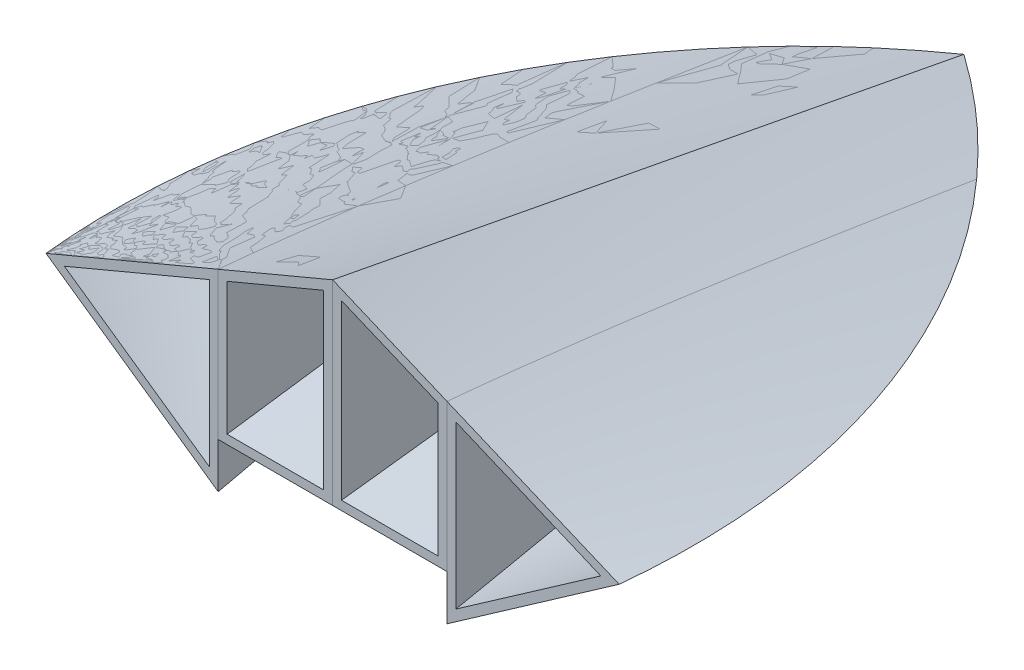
ISO-10303-21;
HEADER;
FILE_DESCRIPTION(('STEP AP214'),'2;1');
FILE_NAME('part.step','',(''),(''),'','','');
FILE_SCHEMA(('AUTOMOTIVE_DESIGN { 1 0 10303 214 1 1 1 1 }'));
ENDSEC;
DATA;
#1=APPLICATION_CONTEXT('core data for automotive mechanical design processes');
#2=APPLICATION_PROTOCOL_DEFINITION('international standard','automotive_design',2000,#1);
#3=PRODUCT_CONTEXT('',#1,'mechanical');
#4=PRODUCT('Part','Part','',(#3));
#5=PRODUCT_RELATED_PRODUCT_CATEGORY('part','',(#4));
#6=PRODUCT_DEFINITION_FORMATION('','',#4);
#7=PRODUCT_DEFINITION_CONTEXT('part definition',#1,'design');
#8=PRODUCT_DEFINITION('design','',#6,#7);
#9=PRODUCT_DEFINITION_SHAPE('','',#8);
#10=(LENGTH_UNIT() NAMED_UNIT(*) SI_UNIT(.MILLI.,.METRE.));
#11=(NAMED_UNIT(*) PLANE_ANGLE_UNIT() SI_UNIT($,.RADIAN.));
#12=(NAMED_UNIT(*) SI_UNIT($,.STERADIAN.) SOLID_ANGLE_UNIT());
#13=UNCERTAINTY_MEASURE_WITH_UNIT(LENGTH_MEASURE(1.E-05),#10,'distance_accuracy_value','');
#14=(GEOMETRIC_REPRESENTATION_CONTEXT(3) GLOBAL_UNCERTAINTY_ASSIGNED_CONTEXT((#13)) GLOBAL_UNIT_ASSIGNED_CONTEXT((#10,
#11,#12)) REPRESENTATION_CONTEXT('',''));
#15=CARTESIAN_POINT('',(0.,0.,0.));
#16=DIRECTION('',(0.,0.,1.));
#17=DIRECTION('',(1.,0.,0.));
#18=AXIS2_PLACEMENT_3D('',#15,#16,#17);
#19=CARTESIAN_POINT('',(105.774102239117,0.00399017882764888,0.));
#20=DIRECTION('',(0.,0.,-1.));
#21=DIRECTION('',(1.,0.,0.));
#22=AXIS2_PLACEMENT_3D('',#19,#20,#21);
#23=PLANE('',#22);
#24=DIRECTION('',(0.,1.,0.));
#25=VECTOR('',#24,1.);
#26=CARTESIAN_POINT('',(2.,0.00399017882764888,0.));
#27=LINE('',#26,#25);
#28=CARTESIAN_POINT('',(2.,-14.8238925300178,0.));
#29=VERTEX_POINT('',#28);
#30=CARTESIAN_POINT('',(2.,23.9584061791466,0.));
#31=VERTEX_POINT('',#30);
#32=EDGE_CURVE('E190',#29,#31,#27,.T.);
#33=ORIENTED_EDGE('',*,*,#32,.T.);
#34=CARTESIAN_POINT('',(2.,23.9584061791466,0.));
#35=CARTESIAN_POINT('',(3.80507905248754,23.2026607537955,0.));
#36=CARTESIAN_POINT('',(5.61008491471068,22.4467405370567,0.));
#37=CARTESIAN_POINT('',(9.21996712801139,20.9345910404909,0.));
#38=CARTESIAN_POINT('',(11.0248434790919,20.178361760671,0.));
#39=CARTESIAN_POINT('',(14.6344836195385,18.6656346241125,0.));
#40=CARTESIAN_POINT('',(16.4392474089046,17.9091367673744,0.));
#41=CARTESIAN_POINT('',(20.0486737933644,16.3958995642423,0.));
#42=CARTESIAN_POINT('',(21.8533363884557,15.6391602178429,0.));
#43=CARTESIAN_POINT('',(23.6579540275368,14.8823136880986,0.));
#44=B_SPLINE_CURVE_WITH_KNOTS('',3,(#34,#35,#36,#37,#38,#39,#40,#41,#42,#43),.UNSPECIFIED.,.F.,
.F.,(4,2,2,2,4),(0.,5.87070298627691,11.7414058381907,17.6121086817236,23.4828116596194),.UNSPECIFIED.);
#45=CARTESIAN_POINT('',(23.6579540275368,14.8823136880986,0.));
#46=VERTEX_POINT('',#45);
#47=EDGE_CURVE('E180',#31,#46,#44,.T.);
#48=ORIENTED_EDGE('',*,*,#47,.T.);
#49=DIRECTION('',(0.,-1.,0.));
#50=VECTOR('',#49,1.);
#51=CARTESIAN_POINT('',(23.6579540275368,0.00399017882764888,0.));
#52=LINE('',#51,#50);
#53=CARTESIAN_POINT('',(23.6579540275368,-14.8189534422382,0.));
#54=VERTEX_POINT('',#53);
#55=EDGE_CURVE('E210',#46,#54,#52,.T.);
#56=ORIENTED_EDGE('',*,*,#55,.T.);
#57=CARTESIAN_POINT('',(2.,-14.8238925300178,0.));
#58=CARTESIAN_POINT('',(4.92422371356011,-14.8234087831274,0.));
#59=CARTESIAN_POINT('',(7.84844742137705,-14.8228728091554,0.));
#60=CARTESIAN_POINT('',(12.9202182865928,-14.8218063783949,0.));
#61=CARTESIAN_POINT('',(15.06776545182,-14.8213122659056,0.));
#62=CARTESIAN_POINT('',(19.3628597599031,-14.8202178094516,0.));
#63=CARTESIAN_POINT('',(21.510406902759,-14.8196174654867,0.));
#64=CARTESIAN_POINT('',(23.6579540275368,-14.8189534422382,0.));
#65=B_SPLINE_CURVE_WITH_KNOTS('',3,(#57,#58,#59,#60,#61,#62,#63,#64),.UNSPECIFIED.,.F.,.F.,(4,2,
2,4),(0.,8.77267126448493,15.2153129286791,21.6579546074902),.UNSPECIFIED.);
#66=EDGE_CURVE('E202',#29,#54,#65,.T.);
#67=ORIENTED_EDGE('',*,*,#66,.F.);
#68=EDGE_LOOP('',(#33,#48,#56,#67));
#69=FACE_BOUND('',#68,.T.);
#70=DIRECTION('',(1.,0.,0.));
#71=VECTOR('',#70,1.);
#72=CARTESIAN_POINT('',(12.8289770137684,-16.8383069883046,0.));
#73=LINE('',#72,#71);
#74=CARTESIAN_POINT('',(0.,-16.8383069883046,0.));
#75=VERTEX_POINT('',#74);
#76=CARTESIAN_POINT('',(25.6579540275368,-16.8383069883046,0.));
#77=VERTEX_POINT('',#76);
#78=EDGE_CURVE('E133',#75,#77,#73,.T.);
#79=ORIENTED_EDGE('',*,*,#78,.T.);
#80=DIRECTION('',(0.,-1.,0.));
#81=VECTOR('',#80,1.);
#82=CARTESIAN_POINT('',(25.6579540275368,-0.309170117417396,0.));
#83=LINE('',#82,#81);
#84=CARTESIAN_POINT('',(25.6579540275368,16.2199667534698,0.));
#85=VERTEX_POINT('',#84);
#86=EDGE_CURVE('E130',#85,#77,#83,.T.);
#87=ORIENTED_EDGE('',*,*,#86,.F.);
#88=DIRECTION('',(0.921972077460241,-0.387256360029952,0.));
#89=VECTOR('',#88,1.);
#90=CARTESIAN_POINT('',(32.137060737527,13.4985445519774,0.));
#91=LINE('',#90,#89);
#92=CARTESIAN_POINT('',(0.,26.9970891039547,0.));
#93=VERTEX_POINT('',#92);
#94=EDGE_CURVE('E125',#93,#85,#91,.T.);
#95=ORIENTED_EDGE('',*,*,#94,.F.);
#96=DIRECTION('',(0.,1.,0.));
#97=VECTOR('',#96,1.);
#98=CARTESIAN_POINT('',(0.,5.07939105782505,0.));
#99=LINE('',#98,#97);
#100=EDGE_CURVE('E140',#75,#93,#99,.T.);
#101=ORIENTED_EDGE('',*,*,#100,.F.);
#102=EDGE_LOOP('',(#79,#87,#95,#101));
#103=FACE_BOUND('',#102,.T.);
#104=ADVANCED_FACE('F67',(#69,#103),#23,.F.);
#105=CARTESIAN_POINT('',(25.6579540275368,-16.8383069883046,0.));
#106=DIRECTION('',(-1.,0.,0.));
#107=DIRECTION('',(0.,0.140348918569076,-0.990102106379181));
#108=AXIS2_PLACEMENT_3D('',#105,#106,#107);
#109=PLANE('',#108);
#110=DIRECTION('',(0.,0.140348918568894,-0.990102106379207));
#111=VECTOR('',#110,1.);
#112=CARTESIAN_POINT('',(25.6579540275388,-8.41915349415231,-59.3935578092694));
#113=LINE('',#112,#111);
#114=CARTESIAN_POINT('',(25.6579540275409,0.,-118.787115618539));
#115=VERTEX_POINT('',#114);
#116=EDGE_CURVE('E119',#77,#115,#113,.T.);
#117=ORIENTED_EDGE('',*,*,#116,.T.);
#118=CARTESIAN_POINT('',(25.6579540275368,16.2199667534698,0.));
#119=CARTESIAN_POINT('',(25.6579540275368,16.1289346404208,-0.997116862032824));
#120=CARTESIAN_POINT('',(25.6579540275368,16.035851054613,-1.9940446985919));
#121=CARTESIAN_POINT('',(25.6579540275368,15.8458203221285,-3.98753006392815));
#122=CARTESIAN_POINT('',(25.6579540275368,15.7488731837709,-4.98408759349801));
#123=CARTESIAN_POINT('',(25.6579540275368,15.45260218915,-7.97314936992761));
#124=CARTESIAN_POINT('',(25.6579540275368,15.2478420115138,-9.96511626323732));
#125=CARTESIAN_POINT('',(25.6579540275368,14.8254741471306,-13.9476648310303));
#126=CARTESIAN_POINT('',(25.6579540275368,14.6078665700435,-15.9382465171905));
#127=CARTESIAN_POINT('',(25.6579540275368,14.1612298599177,-19.9178538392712));
#128=CARTESIAN_POINT('',(25.6579540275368,13.9322022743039,-21.9068796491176));
#129=CARTESIAN_POINT('',(25.6579540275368,13.463898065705,-25.8837398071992));
#130=CARTESIAN_POINT('',(25.6579540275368,13.2246213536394,-27.8715741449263));
#131=CARTESIAN_POINT('',(25.6579540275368,12.7368577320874,-31.846116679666));
#132=CARTESIAN_POINT('',(25.6579540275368,12.4883707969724,-33.8328248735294));
#133=CARTESIAN_POINT('',(25.6579540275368,11.9831238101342,-37.8049101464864));
#134=CARTESIAN_POINT('',(25.6579540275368,11.7263649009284,-39.7902873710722));
#135=CARTESIAN_POINT('',(25.6579540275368,11.2053295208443,-43.7600467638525));
#136=CARTESIAN_POINT('',(25.6579540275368,10.941053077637,-45.7444289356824));
#137=CARTESIAN_POINT('',(25.6579540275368,10.4056724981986,-49.7122696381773));
#138=CARTESIAN_POINT('',(25.6579540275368,10.1345683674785,-51.6957281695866));
#139=CARTESIAN_POINT('',(25.6579540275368,9.58612224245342,-55.6619177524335));
#140=CARTESIAN_POINT('',(25.6579540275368,9.30877983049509,-57.6446487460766));
#141=CARTESIAN_POINT('',(25.6579540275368,8.74841314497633,-61.6093082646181));
#142=CARTESIAN_POINT('',(25.6579540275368,8.46538886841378,-63.591236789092));
#143=CARTESIAN_POINT('',(25.6579540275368,7.8941361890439,-67.5543435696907));
#144=CARTESIAN_POINT('',(25.6579540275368,7.60590778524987,-69.5355218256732));
#145=CARTESIAN_POINT('',(25.6579540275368,6.92950918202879,-74.1458222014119));
#146=CARTESIAN_POINT('',(25.6579540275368,6.53951890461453,-76.7746773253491));
#147=CARTESIAN_POINT('',(25.6579540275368,5.7519996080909,-82.031258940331));
#148=CARTESIAN_POINT('',(25.6579540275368,5.35447058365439,-84.6589854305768));
#149=CARTESIAN_POINT('',(25.6579540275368,4.55263073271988,-89.9134075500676));
#150=CARTESIAN_POINT('',(25.6579540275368,4.14831989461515,-92.5401031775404));
#151=CARTESIAN_POINT('',(25.6579540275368,3.33363326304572,-97.79217815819));
#152=CARTESIAN_POINT('',(25.6579540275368,2.92325832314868,-100.417557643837));
#153=CARTESIAN_POINT('',(25.6579540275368,2.09696980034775,-105.667438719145));
#154=CARTESIAN_POINT('',(25.6579540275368,1.68105622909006,-108.291940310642));
#155=CARTESIAN_POINT('',(25.6579540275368,0.844186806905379,-113.540122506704));
#156=CARTESIAN_POINT('',(25.6579540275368,0.423230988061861,-116.163803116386));
#157=CARTESIAN_POINT('',(25.6579540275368,7.25665359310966E-13,-118.787115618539));
#158=B_SPLINE_CURVE_WITH_KNOTS('',3,(#118,#119,#120,#121,#122,#123,#124,#125,#126,#127,#128,
#129,#130,#131,#132,#133,#134,#135,#136,#137,#138,#139,#140,#141,#142,#143,#144,#145,#146,#147,
#148,#149,#150,#151,#152,#153,#154,#155,#156,#157),.UNSPECIFIED.,.F.,.F.,(4,2,2,2,2,2,2,2,2,2,2,
2,2,2,2,2,2,2,2,4),(0.,3.00378590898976,6.00756535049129,12.0149029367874,18.0221892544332,
24.0286637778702,30.0351905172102,36.041733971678,42.0474513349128,48.0531465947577,
54.0588370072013,60.0649307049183,66.0710275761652,72.0771255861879,80.049988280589,
88.0228566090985,95.9957385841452,103.967508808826,111.939262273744,119.91096504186),.UNSPECIFIED.);
#159=EDGE_CURVE('E71',#85,#115,#158,.T.);
#160=ORIENTED_EDGE('',*,*,#159,.F.);
#161=ORIENTED_EDGE('',*,*,#86,.T.);
#162=EDGE_LOOP('',(#117,#160,#161));
#163=FACE_BOUND('',#162,.T.);
#164=ADVANCED_FACE('F129',(#163),#109,.F.);
#165=CARTESIAN_POINT('',(0.,-16.8383069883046,0.));
#166=CARTESIAN_POINT('',(0.,0.,-141.580597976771));
#167=CARTESIAN_POINT('',(4.27632567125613,-16.8383069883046,0.));
#168=CARTESIAN_POINT('',(4.74564252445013,0.,-138.231215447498));
#169=CARTESIAN_POINT('',(8.55265134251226,-16.8383069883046,0.));
#170=CARTESIAN_POINT('',(9.26382331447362,0.,-134.641214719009));
#171=CARTESIAN_POINT('',(17.1053026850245,-16.8383069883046,0.));
#172=CARTESIAN_POINT('',(17.8236713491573,0.,-127.027534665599));
#173=CARTESIAN_POINT('',(21.3816283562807,-16.8383069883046,0.));
#174=CARTESIAN_POINT('',(21.8653385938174,0.,-123.003855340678));
#175=CARTESIAN_POINT('',(25.6579540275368,-16.8383069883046,0.));
#176=CARTESIAN_POINT('',(25.6579540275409,0.,-118.787115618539));
#177=B_SPLINE_SURFACE_WITH_KNOTS('',3,1,((#165,#166),(#167,#168),(#169,#170),(#171,#172),(#173,
#174),(#175,#176)),.UNSPECIFIED.,.F.,.F.,.F.,(4,2,4),(2,2),(0.,0.5,1.),(0.,1.),.UNSPECIFIED.);
#178=DIRECTION('',(0.,-0.118098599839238,0.993001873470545));
#179=VECTOR('',#178,1.);
#180=CARTESIAN_POINT('',(0.,-8.4191534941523,-70.7902989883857));
#181=LINE('',#180,#179);
#182=CARTESIAN_POINT('',(0.,0.,-141.580597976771));
#183=VERTEX_POINT('',#182);
#184=EDGE_CURVE('E121',#183,#75,#181,.T.);
#185=CARTESIAN_POINT('',(0.,0.,-141.580597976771));
#186=CARTESIAN_POINT('',(4.74564252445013,0.,-138.231215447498));
#187=CARTESIAN_POINT('',(9.26382331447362,0.,-134.641214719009));
#188=CARTESIAN_POINT('',(17.8236713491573,0.,-127.027534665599));
#189=CARTESIAN_POINT('',(21.8653385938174,0.,-123.003855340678));
#190=CARTESIAN_POINT('',(25.6579540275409,0.,-118.787115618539));
#191=B_SPLINE_CURVE_WITH_KNOTS('',3,(#185,#186,#187,#188,#189,#190),.UNSPECIFIED.,.F.,.F.,(4,2,
4),(0.,0.5,1.),.UNSPECIFIED.);
#192=EDGE_CURVE('E81',#115,#183,#191,.F.);
#193=ORIENTED_EDGE('',*,*,#78,.F.);
#194=ORIENTED_EDGE('',*,*,#184,.F.);
#195=ORIENTED_EDGE('',*,*,#192,.F.);
#196=ORIENTED_EDGE('',*,*,#116,.F.);
#197=EDGE_LOOP('',(#193,#194,#195,#196));
#198=FACE_BOUND('',#197,.T.);
#199=ADVANCED_FACE('F117',(#198),#177,.F.);
#200=CARTESIAN_POINT('',(0.,26.9970891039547,0.));
#201=DIRECTION('',(1.,0.,0.));
#202=DIRECTION('',(0.,-0.187308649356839,-0.982301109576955));
#203=AXIS2_PLACEMENT_3D('',#200,#201,#202);
#204=PLANE('',#203);
#205=DIRECTION('',(0.,0.187308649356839,0.982301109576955));
#206=VECTOR('',#205,1.);
#207=CARTESIAN_POINT('',(0.,13.4985445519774,-70.7902989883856));
#208=LINE('',#207,#206);
#209=EDGE_CURVE('E14',#183,#93,#208,.T.);
#210=ORIENTED_EDGE('',*,*,#209,.F.);
#211=ORIENTED_EDGE('',*,*,#184,.T.);
#212=ORIENTED_EDGE('',*,*,#100,.T.);
#213=EDGE_LOOP('',(#210,#211,#212));
#214=FACE_BOUND('',#213,.T.);
#215=ADVANCED_FACE('F69',(#214),#204,.F.);
#216=CARTESIAN_POINT('',(0.,26.9970891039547,0.));
#217=CARTESIAN_POINT('',(0.,17.9980594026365,-47.1935326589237));
#218=CARTESIAN_POINT('',(0.,8.99902970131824,-94.3870653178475));
#219=CARTESIAN_POINT('',(0.,0.,-141.580597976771));
#220=CARTESIAN_POINT('',(21.4247071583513,17.9980594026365,0.));
#221=CARTESIAN_POINT('',(29.4354540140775,11.9987062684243,-36.4993217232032));
#222=CARTESIAN_POINT('',(37.4462008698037,5.99935313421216,-72.9986434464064));
#223=CARTESIAN_POINT('',(45.4569477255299,0.,-109.49796516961));
#224=CARTESIAN_POINT('',(42.8494143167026,8.99902970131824,0.));
#225=CARTESIAN_POINT('',(51.9142990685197,5.99935313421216,-18.4461291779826));
#226=CARTESIAN_POINT('',(60.9791838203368,2.99967656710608,-36.8922583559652));
#227=CARTESIAN_POINT('',(70.0440685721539,0.,-55.3383875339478));
#228=CARTESIAN_POINT('',(64.274121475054,0.,0.));
#229=CARTESIAN_POINT('',(64.274121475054,0.,0.));
#230=CARTESIAN_POINT('',(64.274121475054,0.,0.));
#231=CARTESIAN_POINT('',(64.274121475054,0.,0.));
#232=B_SPLINE_SURFACE_WITH_KNOTS('',3,3,((#216,#217,#218,#219),(#220,#221,#222,#223),(#224,#225,
#226,#227),(#228,#229,#230,#231)),.UNSPECIFIED.,.F.,.F.,.F.,(4,4),(4,4),(0.,1.),(0.,1.),.UNSPECIFIED.);
#233=ORIENTED_EDGE('',*,*,#94,.T.);
#234=ORIENTED_EDGE('',*,*,#159,.T.);
#235=ORIENTED_EDGE('',*,*,#192,.T.);
#236=ORIENTED_EDGE('',*,*,#209,.T.);
#237=EDGE_LOOP('',(#233,#234,#235,#236));
#238=FACE_BOUND('',#237,.T.);
#239=ADVANCED_FACE('F123',(#238),#232,.T.);
#240=CARTESIAN_POINT('',(23.6579540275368,-16.8383069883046,0.));
#241=DIRECTION('',(-1.,0.,0.));
#242=DIRECTION('',(0.,0.140348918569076,-0.990102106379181));
#243=AXIS2_PLACEMENT_3D('',#240,#241,#242);
#244=PLANE('',#243);
#245=CARTESIAN_POINT('',(23.6579540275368,-14.8189534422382,0.));
#246=CARTESIAN_POINT('',(23.6579540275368,-13.2034172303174,-11.5847915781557));
#247=CARTESIAN_POINT('',(23.6579540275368,-11.5881565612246,-23.1696215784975));
#248=CARTESIAN_POINT('',(23.6579540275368,-8.2857675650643,-46.8584699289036));
#249=CARTESIAN_POINT('',(23.6579540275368,-6.59866219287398,-58.9624914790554));
#250=CARTESIAN_POINT('',(23.6579540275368,-3.22494132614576,-83.170602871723));
#251=CARTESIAN_POINT('',(23.6579540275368,-1.53832583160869,-95.2746927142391));
#252=CARTESIAN_POINT('',(23.6579540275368,0.148073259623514,-107.378812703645));
#253=B_SPLINE_CURVE_WITH_KNOTS('',3,(#245,#246,#247,#248,#249,#250,#251,#252),.UNSPECIFIED.,.F.,
.F.,(4,2,2,4),(0.,35.0906850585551,71.7537858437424,108.416886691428),.UNSPECIFIED.);
#254=CARTESIAN_POINT('',(23.6579540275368,0.148073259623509,-107.378812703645));
#255=VERTEX_POINT('',#254);
#256=EDGE_CURVE('E209',#54,#255,#253,.T.);
#257=ORIENTED_EDGE('',*,*,#256,.F.);
#258=ORIENTED_EDGE('',*,*,#55,.F.);
#259=CARTESIAN_POINT('',(23.6579540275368,14.8823136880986,0.));
#260=CARTESIAN_POINT('',(23.6579540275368,14.7858292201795,-1.00551709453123));
#261=CARTESIAN_POINT('',(23.6579540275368,14.6873193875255,-2.01083815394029));
#262=CARTESIAN_POINT('',(23.6579540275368,14.4864902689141,-4.0210977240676));
#263=CARTESIAN_POINT('',(23.6579540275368,14.3841709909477,-5.02603623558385));
#264=CARTESIAN_POINT('',(23.6579540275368,14.071867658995,-8.04022734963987));
#265=CARTESIAN_POINT('',(23.6579540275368,13.8565312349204,-10.0489267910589));
#266=CARTESIAN_POINT('',(23.6579540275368,13.4132434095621,-14.0649112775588));
#267=CARTESIAN_POINT('',(23.6579540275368,13.185292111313,-16.0721963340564));
#268=CARTESIAN_POINT('',(23.6579540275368,12.7182019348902,-20.0852154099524));
#269=CARTESIAN_POINT('',(23.6579540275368,12.4790644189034,-22.0909495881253));
#270=CARTESIAN_POINT('',(23.6579540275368,11.99077546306,-26.1012136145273));
#271=CARTESIAN_POINT('',(23.6579540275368,11.7416239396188,-28.1057434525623));
#272=CARTESIAN_POINT('',(23.6579540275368,11.2343429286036,-32.1136707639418));
#273=CARTESIAN_POINT('',(23.6579540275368,10.9762134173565,-34.1170682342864));
#274=CARTESIAN_POINT('',(23.6579540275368,10.4543541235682,-38.1038563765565));
#275=CARTESIAN_POINT('',(23.6579540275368,10.1907004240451,-40.0872570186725));
#276=CARTESIAN_POINT('',(23.6579540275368,9.65622539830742,-44.0530842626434));
#277=CARTESIAN_POINT('',(23.6579540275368,9.38540409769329,-46.0355108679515));
#278=CARTESIAN_POINT('',(23.6579540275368,8.83725916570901,-49.9994626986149));
#279=CARTESIAN_POINT('',(23.6579540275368,8.55993553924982,-51.9809879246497));
#280=CARTESIAN_POINT('',(23.6579540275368,7.99935692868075,-55.9433067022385));
#281=CARTESIAN_POINT('',(23.6579540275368,7.71610162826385,-57.9241002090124));
#282=CARTESIAN_POINT('',(23.6579540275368,7.14419196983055,-61.8849082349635));
#283=CARTESIAN_POINT('',(23.6579540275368,6.85553760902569,-63.8649227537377));
#284=CARTESIAN_POINT('',(23.6579540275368,6.27328950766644,-67.8242252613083));
#285=CARTESIAN_POINT('',(23.6579540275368,5.97969576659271,-69.8035132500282));
#286=CARTESIAN_POINT('',(23.6579540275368,5.38790320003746,-73.7619121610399));
#287=CARTESIAN_POINT('',(23.6579540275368,5.08970322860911,-75.7410229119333));
#288=CARTESIAN_POINT('',(23.6579540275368,4.48913641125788,-79.6986113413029));
#289=CARTESIAN_POINT('',(23.6579540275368,4.18676956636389,-81.6770890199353));
#290=CARTESIAN_POINT('',(23.6579540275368,3.57819640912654,-85.6334545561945));
#291=CARTESIAN_POINT('',(23.6579540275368,3.27199009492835,-87.611342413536));
#292=CARTESIAN_POINT('',(23.6579540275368,2.65606042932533,-91.5663837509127));
#293=CARTESIAN_POINT('',(23.6579540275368,2.34633740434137,-93.5435372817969));
#294=CARTESIAN_POINT('',(23.6579540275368,1.72361313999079,-97.4973265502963));
#295=CARTESIAN_POINT('',(23.6579540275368,1.41061190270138,-99.4739622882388));
#296=CARTESIAN_POINT('',(23.6579540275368,0.781566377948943,-103.426744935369));
#297=CARTESIAN_POINT('',(23.6579540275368,0.465522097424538,-105.402891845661));
#298=CARTESIAN_POINT('',(23.6579540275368,0.148073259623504,-107.378812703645));
#299=B_SPLINE_CURVE_WITH_KNOTS('',3,(#259,#260,#261,#262,#263,#264,#265,#266,#267,#268,#269,
#270,#271,#272,#273,#274,#275,#276,#277,#278,#279,#280,#281,#282,#283,#284,#285,#286,#287,#288,
#289,#290,#291,#292,#293,#294,#295,#296,#297,#298),.UNSPECIFIED.,.F.,.F.,(4,2,2,2,2,2,2,2,2,2,2,
2,2,2,2,2,2,2,2,4),(0.,3.03040185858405,6.06079736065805,12.1213736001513,18.1819003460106,
24.2416909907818,30.3015322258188,36.3613894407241,42.3639180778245,48.3664252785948,
54.3689279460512,60.371751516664,66.3745781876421,72.3774054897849,78.3817510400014,
84.3860951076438,90.3904420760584,96.3942362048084,102.398026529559,108.401803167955),.UNSPECIFIED.);
#300=EDGE_CURVE('E89',#46,#255,#299,.T.);
#301=ORIENTED_EDGE('',*,*,#300,.T.);
#302=EDGE_LOOP('',(#257,#258,#301));
#303=FACE_BOUND('',#302,.T.);
#304=ADVANCED_FACE('F217',(#303),#244,.T.);
#305=CARTESIAN_POINT('',(0.,-16.8383069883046,0.));
#306=CARTESIAN_POINT('',(0.,0.,-141.580597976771));
#307=CARTESIAN_POINT('',(4.27632567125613,-16.8383069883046,0.));
#308=CARTESIAN_POINT('',(4.74564252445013,0.,-138.231215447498));
#309=CARTESIAN_POINT('',(8.55265134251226,-16.8383069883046,0.));
#310=CARTESIAN_POINT('',(9.26382331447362,0.,-134.641214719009));
#311=CARTESIAN_POINT('',(17.1053026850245,-16.8383069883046,0.));
#312=CARTESIAN_POINT('',(17.8236713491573,0.,-127.027534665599));
#313=CARTESIAN_POINT('',(21.3816283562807,-16.8383069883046,0.));
#314=CARTESIAN_POINT('',(21.8653385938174,0.,-123.003855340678));
#315=CARTESIAN_POINT('',(25.6579540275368,-16.8383069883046,0.));
#316=CARTESIAN_POINT('',(25.6579540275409,0.,-118.787115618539));
#317=B_SPLINE_SURFACE_WITH_KNOTS('',3,1,((#305,#306),(#307,#308),(#309,#310),(#311,#312),(#313,
#314),(#315,#316)),.UNSPECIFIED.,.F.,.F.,.F.,(4,2,4),(2,2),(0.,0.5,1.),(0.,1.),.UNSPECIFIED.);
#318=OFFSET_SURFACE('',#317,2.,.F.);
#319=ORIENTED_EDGE('',*,*,#66,.T.);
#320=ORIENTED_EDGE('',*,*,#256,.T.);
#321=CARTESIAN_POINT('',(23.6579540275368,0.148073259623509,-107.378812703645));
#322=CARTESIAN_POINT('',(22.6636558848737,0.166120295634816,-108.451557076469));
#323=CARTESIAN_POINT('',(21.6552899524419,0.183492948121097,-109.511285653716));
#324=CARTESIAN_POINT('',(19.6108817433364,0.217006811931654,-111.603726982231));
#325=CARTESIAN_POINT('',(18.5748393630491,0.233148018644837,-112.63643963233));
#326=CARTESIAN_POINT('',(16.4755333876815,0.264316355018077,-114.673868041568));
#327=CARTESIAN_POINT('',(15.4122694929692,0.279343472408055,-115.678583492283));
#328=CARTESIAN_POINT('',(13.2590950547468,0.30838185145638,-117.659054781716));
#329=CARTESIAN_POINT('',(12.1691843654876,0.322393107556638,-118.63481046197));
#330=CARTESIAN_POINT('',(9.60022642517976,0.353949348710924,-120.87274676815));
#331=CARTESIAN_POINT('',(8.11118086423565,0.371139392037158,-122.123485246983));
#332=CARTESIAN_POINT('',(5.08854032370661,0.404058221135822,-124.570300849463));
#333=CARTESIAN_POINT('',(3.55494020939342,0.419786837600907,-125.766371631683));
#334=CARTESIAN_POINT('',(1.99999999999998,0.434870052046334,-126.933999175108));
#335=B_SPLINE_CURVE_WITH_KNOTS('',3,(#321,#322,#323,#324,#325,#326,#327,#328,#329,#330,#331,
#332,#333,#334),.UNSPECIFIED.,.F.,.F.,(4,2,2,2,2,2,4),(0.,4.38823642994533,8.77648929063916,
13.1647904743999,17.5531156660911,23.385929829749,29.2194188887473),.UNSPECIFIED.);
#336=CARTESIAN_POINT('',(1.99999999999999,0.43487005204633,-126.933999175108));
#337=VERTEX_POINT('',#336);
#338=EDGE_CURVE('E229',#255,#337,#335,.T.);
#339=ORIENTED_EDGE('',*,*,#338,.T.);
#340=CARTESIAN_POINT('',(1.99999999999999,0.43487005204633,-126.933999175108));
#341=CARTESIAN_POINT('',(1.99999999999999,-2.35569968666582,-103.707244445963));
#342=CARTESIAN_POINT('',(1.99999999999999,-5.14709372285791,-80.4805888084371));
#343=CARTESIAN_POINT('',(2.,-10.233615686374,-38.1692879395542));
#344=CARTESIAN_POINT('',(2.,-12.5284758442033,-19.0846105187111));
#345=CARTESIAN_POINT('',(2.,-14.8238925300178,0.));
#346=B_SPLINE_CURVE_WITH_KNOTS('',3,(#340,#341,#342,#343,#344,#345),.UNSPECIFIED.,.F.,.F.,(4,2,
4),(0.,70.1813701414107,127.847839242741),.UNSPECIFIED.);
#347=EDGE_CURVE('E189',#337,#29,#346,.T.);
#348=ORIENTED_EDGE('',*,*,#347,.T.);
#349=EDGE_LOOP('',(#319,#320,#339,#348));
#350=FACE_BOUND('',#349,.T.);
#351=ADVANCED_FACE('F212',(#350),#318,.T.);
#352=CARTESIAN_POINT('',(2.,26.9970891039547,0.));
#353=DIRECTION('',(1.,0.,0.));
#354=DIRECTION('',(0.,-0.187308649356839,-0.982301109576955));
#355=AXIS2_PLACEMENT_3D('',#352,#353,#354);
#356=PLANE('',#355);
#357=CARTESIAN_POINT('',(1.99999999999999,0.43487005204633,-126.933999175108));
#358=CARTESIAN_POINT('',(1.99999999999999,1.55570101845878,-120.979755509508));
#359=CARTESIAN_POINT('',(1.99999999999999,2.67551282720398,-115.025319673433));
#360=CARTESIAN_POINT('',(1.99999999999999,4.91233810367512,-103.115915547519));
#361=CARTESIAN_POINT('',(1.99999999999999,6.02935156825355,-97.1609472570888));
#362=CARTESIAN_POINT('',(1.99999999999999,8.2598176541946,-85.2503432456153));
#363=CARTESIAN_POINT('',(1.99999999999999,9.37327027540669,-79.2947075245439));
#364=CARTESIAN_POINT('',(1.99999999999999,11.0398873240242,-70.3605919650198));
#365=CARTESIAN_POINT('',(1.99999999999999,11.5948324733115,-67.3824442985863));
#366=CARTESIAN_POINT('',(1.99999999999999,12.7033374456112,-61.4258906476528));
#367=CARTESIAN_POINT('',(2.,13.2568972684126,-58.4474846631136));
#368=CARTESIAN_POINT('',(2.,14.3812543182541,-52.3887566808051));
#369=CARTESIAN_POINT('',(2.,14.9519953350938,-49.3084242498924));
#370=CARTESIAN_POINT('',(2.,16.0914212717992,-43.1473793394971));
#371=CARTESIAN_POINT('',(2.,16.6601061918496,-40.0666668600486));
#372=CARTESIAN_POINT('',(2.,17.7950135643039,-33.9047894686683));
#373=CARTESIAN_POINT('',(2.,18.3612360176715,-30.823624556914));
#374=CARTESIAN_POINT('',(2.,19.4907031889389,-24.6607384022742));
#375=CARTESIAN_POINT('',(2.,20.0539478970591,-21.5790171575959));
#376=CARTESIAN_POINT('',(2.,21.1767934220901,-15.4149093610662));
#377=CARTESIAN_POINT('',(2.,21.7363942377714,-12.3325228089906));
#378=CARTESIAN_POINT('',(2.,22.5724044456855,-7.7083271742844));
#379=CARTESIAN_POINT('',(2.,22.8505095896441,-6.16682463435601));
#380=CARTESIAN_POINT('',(2.,23.4054475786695,-3.08359033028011));
#381=CARTESIAN_POINT('',(2.,23.6822804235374,-1.5418585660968));
#382=CARTESIAN_POINT('',(2.,23.9584061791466,0.));
#383=B_SPLINE_CURVE_WITH_KNOTS('',3,(#357,#358,#359,#360,#361,#362,#363,#364,#365,#366,#367,
#368,#369,#370,#371,#372,#373,#374,#375,#376,#377,#378,#379,#380,#381,#382),.UNSPECIFIED.,.F.,
.F.,(4,2,2,2,2,2,2,2,2,2,2,2,4),(0.,18.176455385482,36.3529312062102,54.5294077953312,
63.6176388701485,72.7058713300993,82.1041545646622,91.5024369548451,100.900715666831,
110.299025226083,119.697337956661,124.396502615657,129.095668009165),.UNSPECIFIED.);
#384=EDGE_CURVE('E143',#337,#31,#383,.T.);
#385=ORIENTED_EDGE('',*,*,#384,.T.);
#386=ORIENTED_EDGE('',*,*,#32,.F.);
#387=ORIENTED_EDGE('',*,*,#347,.F.);
#388=EDGE_LOOP('',(#385,#386,#387));
#389=FACE_BOUND('',#388,.T.);
#390=ADVANCED_FACE('F216',(#389),#356,.T.);
#391=CARTESIAN_POINT('',(0.,26.9970891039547,0.));
#392=CARTESIAN_POINT('',(0.,17.9980594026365,-47.1935326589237));
#393=CARTESIAN_POINT('',(0.,8.99902970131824,-94.3870653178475));
#394=CARTESIAN_POINT('',(0.,0.,-141.580597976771));
#395=CARTESIAN_POINT('',(21.4247071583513,17.9980594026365,0.));
#396=CARTESIAN_POINT('',(29.4354540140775,11.9987062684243,-36.4993217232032));
#397=CARTESIAN_POINT('',(37.4462008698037,5.99935313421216,-72.9986434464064));
#398=CARTESIAN_POINT('',(45.4569477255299,0.,-109.49796516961));
#399=CARTESIAN_POINT('',(42.8494143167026,8.99902970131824,0.));
#400=CARTESIAN_POINT('',(51.9142990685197,5.99935313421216,-18.4461291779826));
#401=CARTESIAN_POINT('',(60.9791838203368,2.99967656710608,-36.8922583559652));
#402=CARTESIAN_POINT('',(70.0440685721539,0.,-55.3383875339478));
#403=CARTESIAN_POINT('',(64.274121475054,0.,0.));
#404=CARTESIAN_POINT('',(64.274121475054,0.,0.));
#405=CARTESIAN_POINT('',(64.274121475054,0.,0.));
#406=CARTESIAN_POINT('',(64.274121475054,0.,0.));
#407=B_SPLINE_SURFACE_WITH_KNOTS('',3,3,((#391,#392,#393,#394),(#395,#396,#397,#398),(#399,#400,
#401,#402),(#403,#404,#405,#406)),.UNSPECIFIED.,.F.,.F.,.F.,(4,4),(4,4),(0.,1.),(0.,1.),.UNSPECIFIED.);
#408=OFFSET_SURFACE('',#407,-2.,.F.);
#409=ORIENTED_EDGE('',*,*,#47,.F.);
#410=ORIENTED_EDGE('',*,*,#384,.F.);
#411=ORIENTED_EDGE('',*,*,#338,.F.);
#412=ORIENTED_EDGE('',*,*,#300,.F.);
#413=EDGE_LOOP('',(#409,#410,#411,#412));
#414=FACE_BOUND('',#413,.T.);
#415=ADVANCED_FACE('F192',(#414),#408,.F.);
#416=CLOSED_SHELL('',(#104,#164,#199,#215,#239,#304,#351,#390,#415));
#417=MANIFOLD_SOLID_BREP('B2',#416);
#418=CARTESIAN_POINT('',(64.274121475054,0.,0.));
#419=DIRECTION('',(0.,0.,-1.));
#420=DIRECTION('',(1.,0.,0.));
#421=AXIS2_PLACEMENT_3D('',#418,#419,#420);
#422=PLANE('',#421);
#423=DIRECTION('',(-0.819652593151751,-0.572860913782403,0.));
#424=VECTOR('',#423,1.);
#425=CARTESIAN_POINT('',(44.9660377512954,-13.4945543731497,0.));
#426=LINE('',#425,#424);
#427=CARTESIAN_POINT('',(64.274121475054,0.,0.));
#428=VERTEX_POINT('',#427);
#429=CARTESIAN_POINT('',(25.6579540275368,-26.9891087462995,0.));
#430=VERTEX_POINT('',#429);
#431=EDGE_CURVE('E587',#428,#430,#426,.T.);
#432=ORIENTED_EDGE('',*,*,#431,.F.);
#433=DIRECTION('',(0.921972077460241,-0.387256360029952,0.));
#434=VECTOR('',#433,1.);
#435=CARTESIAN_POINT('',(32.137060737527,13.4985445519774,0.));
#436=LINE('',#435,#434);
#437=CARTESIAN_POINT('',(25.6579540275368,16.2199667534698,0.));
#438=VERTEX_POINT('',#437);
#439=EDGE_CURVE('E473',#438,#428,#436,.T.);
#440=ORIENTED_EDGE('',*,*,#439,.F.);
#441=DIRECTION('',(0.,1.,0.));
#442=VECTOR('',#441,1.);
#443=CARTESIAN_POINT('',(25.6579540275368,-26.9891087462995,0.));
#444=LINE('',#443,#442);
#445=EDGE_CURVE('E513',#430,#438,#444,.T.);
#446=ORIENTED_EDGE('',*,*,#445,.F.);
#447=EDGE_LOOP('',(#432,#440,#446));
#448=FACE_BOUND('',#447,.T.);
#449=CARTESIAN_POINT('',(60.1519355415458,-0.438763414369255,0.));
#450=CARTESIAN_POINT('',(56.8943545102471,-2.71748383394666,0.));
#451=CARTESIAN_POINT('',(53.6361752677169,-4.99534963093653,0.));
#452=CARTESIAN_POINT('',(47.118414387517,-9.54907400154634,0.));
#453=CARTESIAN_POINT('',(43.8588327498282,-11.824932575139,0.));
#454=CARTESIAN_POINT('',(36.2864352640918,-17.108042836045,0.));
#455=CARTESIAN_POINT('',(31.9730170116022,-20.1144310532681,0.));
#456=CARTESIAN_POINT('',(27.6579540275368,-23.1184584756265,0.));
#457=B_SPLINE_CURVE_WITH_KNOTS('',3,(#449,#450,#451,#452,#453,#454,#455,#456),.UNSPECIFIED.,.F.,
.F.,(4,2,2,4),(0.,11.9264251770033,23.8528505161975,39.6261022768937),.UNSPECIFIED.);
#458=CARTESIAN_POINT('',(60.1519355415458,-0.438763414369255,0.));
#459=VERTEX_POINT('',#458);
#460=CARTESIAN_POINT('',(27.6579540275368,-23.1184584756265,0.));
#461=VERTEX_POINT('',#460);
#462=EDGE_CURVE('E509',#459,#461,#457,.T.);
#463=ORIENTED_EDGE('',*,*,#462,.T.);
#464=DIRECTION('',(0.,1.,0.));
#465=VECTOR('',#464,1.);
#466=CARTESIAN_POINT('',(27.6579540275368,0.,0.));
#467=LINE('',#466,#465);
#468=CARTESIAN_POINT('',(27.6579540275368,13.2045265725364,0.));
#469=VERTEX_POINT('',#468);
#470=EDGE_CURVE('E518',#461,#469,#467,.T.);
#471=ORIENTED_EDGE('',*,*,#470,.T.);
#472=CARTESIAN_POINT('',(27.6579540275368,13.2045265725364,0.));
#473=CARTESIAN_POINT('',(33.0743235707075,10.9323262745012,0.));
#474=CARTESIAN_POINT('',(38.490340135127,8.65928529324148,0.));
#475=CARTESIAN_POINT('',(49.3216673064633,4.11152196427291,0.));
#476=CARTESIAN_POINT('',(54.7369779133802,1.83679961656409,0.));
#477=CARTESIAN_POINT('',(60.1519355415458,-0.43876341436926,0.));
#478=B_SPLINE_CURVE_WITH_KNOTS('',3,(#472,#473,#474,#475,#476,#477),.UNSPECIFIED.,.F.,.F.,(4,2,
4),(0.,17.6209976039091,35.2419952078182),.UNSPECIFIED.);
#479=EDGE_CURVE('E514',#469,#459,#478,.T.);
#480=ORIENTED_EDGE('',*,*,#479,.T.);
#481=EDGE_LOOP('',(#463,#471,#480));
#482=FACE_BOUND('',#481,.T.);
#483=ADVANCED_FACE('F460',(#448,#482),#422,.F.);
#484=CARTESIAN_POINT('',(25.6579540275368,-26.9891087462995,0.));
#485=DIRECTION('',(1.,0.,0.));
#486=DIRECTION('',(0.,0.,1.));
#487=AXIS2_PLACEMENT_3D('',#484,#485,#486);
#488=PLANE('',#487);
#489=CARTESIAN_POINT('',(25.6579540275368,16.2199667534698,0.));
#490=CARTESIAN_POINT('',(25.6579540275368,16.1289346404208,-0.997116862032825));
#491=CARTESIAN_POINT('',(25.6579540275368,16.035851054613,-1.9940446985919));
#492=CARTESIAN_POINT('',(25.6579540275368,15.8458203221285,-3.98753006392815));
#493=CARTESIAN_POINT('',(25.6579540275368,15.7488731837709,-4.98408759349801));
#494=CARTESIAN_POINT('',(25.6579540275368,15.45260218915,-7.97314936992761));
#495=CARTESIAN_POINT('',(25.6579540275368,15.2478420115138,-9.96511626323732));
#496=CARTESIAN_POINT('',(25.6579540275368,14.8254741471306,-13.9476648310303));
#497=CARTESIAN_POINT('',(25.6579540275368,14.6078665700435,-15.9382465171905));
#498=CARTESIAN_POINT('',(25.6579540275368,14.1612298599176,-19.9178538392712));
#499=CARTESIAN_POINT('',(25.6579540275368,13.9322022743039,-21.9068796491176));
#500=CARTESIAN_POINT('',(25.6579540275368,13.463898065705,-25.8837398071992));
#501=CARTESIAN_POINT('',(25.6579540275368,13.2246213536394,-27.8715741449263));
#502=CARTESIAN_POINT('',(25.6579540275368,12.7368577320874,-31.846116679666));
#503=CARTESIAN_POINT('',(25.6579540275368,12.4883707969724,-33.8328248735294));
#504=CARTESIAN_POINT('',(25.6579540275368,11.9831238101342,-37.8049101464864));
#505=CARTESIAN_POINT('',(25.6579540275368,11.7263649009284,-39.7902873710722));
#506=CARTESIAN_POINT('',(25.6579540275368,11.2053295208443,-43.7600467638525));
#507=CARTESIAN_POINT('',(25.6579540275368,10.941053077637,-45.7444289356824));
#508=CARTESIAN_POINT('',(25.6579540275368,10.4056724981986,-49.7122696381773));
#509=CARTESIAN_POINT('',(25.6579540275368,10.1345683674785,-51.6957281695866));
#510=CARTESIAN_POINT('',(25.6579540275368,9.58612224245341,-55.6619177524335));
#511=CARTESIAN_POINT('',(25.6579540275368,9.30877983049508,-57.6446487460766));
#512=CARTESIAN_POINT('',(25.6579540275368,8.74841314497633,-61.6093082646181));
#513=CARTESIAN_POINT('',(25.6579540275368,8.46538886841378,-63.591236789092));
#514=CARTESIAN_POINT('',(25.6579540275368,7.8941361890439,-67.5543435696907));
#515=CARTESIAN_POINT('',(25.6579540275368,7.60590778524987,-69.5355218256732));
#516=CARTESIAN_POINT('',(25.6579540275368,6.92950918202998,-74.1458222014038));
#517=CARTESIAN_POINT('',(25.6579540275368,6.53951890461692,-76.774677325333));
#518=CARTESIAN_POINT('',(25.6579540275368,5.75199960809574,-82.0312589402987));
#519=CARTESIAN_POINT('',(25.6579540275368,5.35447058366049,-84.6589854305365));
#520=CARTESIAN_POINT('',(25.6579540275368,4.55263073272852,-89.9134075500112));
#521=CARTESIAN_POINT('',(25.6579540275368,4.14831989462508,-92.540103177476));
#522=CARTESIAN_POINT('',(25.6579540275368,3.33363326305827,-97.7921781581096));
#523=CARTESIAN_POINT('',(25.6579540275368,2.92325832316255,-100.417557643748));
#524=CARTESIAN_POINT('',(25.6579540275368,2.09696980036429,-105.667438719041));
#525=CARTESIAN_POINT('',(25.6579540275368,1.68105622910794,-108.291940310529));
#526=CARTESIAN_POINT('',(25.6579540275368,0.84418680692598,-113.540122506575));
#527=CARTESIAN_POINT('',(25.6579540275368,0.423230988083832,-116.163803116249));
#528=CARTESIAN_POINT('',(25.6579540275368,2.40773869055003E-11,-118.787115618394));
#529=B_SPLINE_CURVE_WITH_KNOTS('',3,(#489,#490,#491,#492,#493,#494,#495,#496,#497,#498,#499,
#500,#501,#502,#503,#504,#505,#506,#507,#508,#509,#510,#511,#512,#513,#514,#515,#516,#517,#518,
#519,#520,#521,#522,#523,#524,#525,#526,#527,#528),.UNSPECIFIED.,.F.,.F.,(4,2,2,2,2,2,2,2,2,2,2,
2,2,2,2,2,2,2,2,4),(0.,3.00378590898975,6.00756535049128,12.0149029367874,18.0221892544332,
24.0286637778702,30.0351905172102,36.041733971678,42.0474513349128,48.0531465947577,
54.0588370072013,60.0649307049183,66.0710275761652,72.0771255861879,80.0499882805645,
88.0228566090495,95.9957385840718,103.967508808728,111.939262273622,119.910965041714),.UNSPECIFIED.);
#530=CARTESIAN_POINT('',(25.6579540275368,1.20386934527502E-11,-118.787115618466));
#531=VERTEX_POINT('',#530);
#532=EDGE_CURVE('E463',#438,#531,#529,.T.);
#533=ORIENTED_EDGE('',*,*,#532,.T.);
#534=DIRECTION('',(0.,0.221558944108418,-0.975146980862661));
#535=VECTOR('',#534,1.);
#536=CARTESIAN_POINT('',(25.6579540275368,-13.4945543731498,-59.3935578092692));
#537=LINE('',#536,#535);
#538=EDGE_CURVE('E584',#430,#531,#537,.T.);
#539=ORIENTED_EDGE('',*,*,#538,.F.);
#540=ORIENTED_EDGE('',*,*,#445,.T.);
#541=EDGE_LOOP('',(#533,#539,#540));
#542=FACE_BOUND('',#541,.T.);
#543=ADVANCED_FACE('F557',(#542),#488,.F.);
#544=CARTESIAN_POINT('',(25.6579540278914,0.,-118.787115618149));
#545=CARTESIAN_POINT('',(25.6579540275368,0.,-118.787115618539));
#546=CARTESIAN_POINT('',(40.0294460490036,0.,-102.808474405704));
#547=CARTESIAN_POINT('',(25.6579540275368,-4.49818479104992,-98.9892630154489));
#548=CARTESIAN_POINT('',(50.8247874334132,0.,-84.0576667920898));
#549=CARTESIAN_POINT('',(25.6579540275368,-8.99636958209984,-79.191410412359));
#550=CARTESIAN_POINT('',(64.0884246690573,0.,-43.5994008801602));
#551=CARTESIAN_POINT('',(25.6579540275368,-17.9927391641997,-39.5957052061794));
#552=CARTESIAN_POINT('',(66.5567205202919,0.,-21.8919425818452));
#553=CARTESIAN_POINT('',(25.6579540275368,-22.4909239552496,-19.7978526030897));
#554=CARTESIAN_POINT('',(64.274121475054,0.,0.));
#555=CARTESIAN_POINT('',(25.6579540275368,-26.9891087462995,0.));
#556=CARTESIAN_POINT('',(64.2284694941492,0.,0.437838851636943));
#557=CARTESIAN_POINT('',(25.6579540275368,-27.0790724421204,0.395957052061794));
#558=CARTESIAN_POINT('',(64.1828175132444,0.,0.875677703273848));
#559=CARTESIAN_POINT('',(25.6579540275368,-27.1690361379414,0.791914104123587));
#560=CARTESIAN_POINT('',(64.1371655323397,0.,1.31351655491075));
#561=CARTESIAN_POINT('',(25.6579540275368,-27.2589998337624,1.18787115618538));
#562=B_SPLINE_SURFACE_WITH_KNOTS('',3,1,((#544,#545),(#546,#547),(#548,#549),(#550,#551),(#552,
#553),(#554,#555),(#556,#557),(#558,#559),(#560,#561)),.UNSPECIFIED.,.F.,.F.,.F.,(4,2,3,4),(2,
2),(0.,0.5,1.,1.01),(0.,1.),.UNSPECIFIED.);
#563=CARTESIAN_POINT('',(25.6579540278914,0.,-118.787115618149));
#564=CARTESIAN_POINT('',(40.0294460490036,0.,-102.808474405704));
#565=CARTESIAN_POINT('',(50.8247874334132,0.,-84.0576667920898));
#566=CARTESIAN_POINT('',(64.0884246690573,0.,-43.5994008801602));
#567=CARTESIAN_POINT('',(66.5567205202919,0.,-21.8919425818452));
#568=CARTESIAN_POINT('',(64.274121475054,0.,0.));
#569=B_SPLINE_CURVE_WITH_KNOTS('',3,(#563,#564,#565,#566,#567,#568),.UNSPECIFIED.,.F.,.F.,(4,2,
4),(0.,0.5,1.),.UNSPECIFIED.);
#570=EDGE_CURVE('E65',#428,#531,#569,.F.);
#571=ORIENTED_EDGE('',*,*,#570,.F.);
#572=ORIENTED_EDGE('',*,*,#431,.T.);
#573=ORIENTED_EDGE('',*,*,#538,.T.);
#574=EDGE_LOOP('',(#571,#572,#573));
#575=FACE_BOUND('',#574,.T.);
#576=ADVANCED_FACE('F561',(#575),#562,.T.);
#577=CARTESIAN_POINT('',(0.,27.333994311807,1.76682903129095));
#578=CARTESIAN_POINT('',(0.,27.2216925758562,1.17788602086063));
#579=CARTESIAN_POINT('',(0.,27.1093908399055,0.588943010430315));
#580=CARTESIAN_POINT('',(0.,26.9970891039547,0.));
#581=CARTESIAN_POINT('',(0.,17.9980594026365,-47.1935326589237));
#582=CARTESIAN_POINT('',(0.,8.99902970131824,-94.3870653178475));
#583=CARTESIAN_POINT('',(0.,0.,-141.580597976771));
#584=CARTESIAN_POINT('',(21.1248012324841,18.222662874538,1.36645971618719));
#585=CARTESIAN_POINT('',(21.2247698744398,18.1477950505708,0.910973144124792));
#586=CARTESIAN_POINT('',(21.3247385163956,18.0729272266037,0.455486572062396));
#587=CARTESIAN_POINT('',(21.4247071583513,17.9980594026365,0.));
#588=CARTESIAN_POINT('',(29.4354540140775,11.9987062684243,-36.4993217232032));
#589=CARTESIAN_POINT('',(37.4462008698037,5.99935313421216,-72.9986434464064));
#590=CARTESIAN_POINT('',(45.4569477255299,0.,-109.49796516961));
#591=CARTESIAN_POINT('',(42.5100436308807,9.11133143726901,0.690585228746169));
#592=CARTESIAN_POINT('',(42.6231671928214,9.07389752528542,0.460390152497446));
#593=CARTESIAN_POINT('',(42.736290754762,9.03646361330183,0.230195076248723));
#594=CARTESIAN_POINT('',(42.8494143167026,8.99902970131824,0.));
#595=CARTESIAN_POINT('',(51.9142990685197,5.99935313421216,-18.4461291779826));
#596=CARTESIAN_POINT('',(60.9791838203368,2.99967656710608,-36.8922583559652));
#597=CARTESIAN_POINT('',(70.0440685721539,0.,-55.3383875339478));
#598=CARTESIAN_POINT('',(64.274121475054,0.,0.));
#599=CARTESIAN_POINT('',(64.274121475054,0.,0.));
#600=CARTESIAN_POINT('',(64.274121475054,0.,0.));
#601=CARTESIAN_POINT('',(64.274121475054,0.,0.));
#602=CARTESIAN_POINT('',(64.274121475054,0.,0.));
#603=CARTESIAN_POINT('',(64.274121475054,0.,0.));
#604=CARTESIAN_POINT('',(64.274121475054,0.,0.));
#605=B_SPLINE_SURFACE_WITH_KNOTS('',3,3,((#577,#578,#579,#580,#581,#582,#583),(#584,#585,#586,
#587,#588,#589,#590),(#591,#592,#593,#594,#595,#596,#597),(#598,#599,#600,#601,#602,#603,#604)),
.UNSPECIFIED.,.F.,.F.,.F.,(4,4),(4,3,4),(0.,1.),(-0.0124793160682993,0.,1.),.UNSPECIFIED.);
#606=ORIENTED_EDGE('',*,*,#532,.F.);
#607=ORIENTED_EDGE('',*,*,#439,.T.);
#608=ORIENTED_EDGE('',*,*,#570,.T.);
#609=EDGE_LOOP('',(#606,#607,#608));
#610=FACE_BOUND('',#609,.T.);
#611=ADVANCED_FACE('F544',(#610),#605,.T.);
#612=CARTESIAN_POINT('',(27.6579540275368,-26.9891087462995,0.));
#613=DIRECTION('',(1.,0.,0.));
#614=DIRECTION('',(0.,0.,1.));
#615=AXIS2_PLACEMENT_3D('',#612,#613,#614);
#616=PLANE('',#615);
#617=CARTESIAN_POINT('',(27.6579540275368,13.2045265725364,0.));
#618=CARTESIAN_POINT('',(27.6579540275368,13.122339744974,-1.00688897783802));
#619=CARTESIAN_POINT('',(27.6579540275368,13.0378301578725,-2.01358614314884));
#620=CARTESIAN_POINT('',(27.6579540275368,12.8644428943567,-4.02660164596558));
#621=CARTESIAN_POINT('',(27.6579540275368,12.7755652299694,-5.03291998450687));
#622=CARTESIAN_POINT('',(27.6579540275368,12.5028039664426,-8.05122929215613));
#623=CARTESIAN_POINT('',(27.6579540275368,12.3127844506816,-10.0626675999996));
#624=CARTESIAN_POINT('',(27.6579540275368,11.9182847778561,-14.0840971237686));
#625=CARTESIAN_POINT('',(27.6579540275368,11.7138047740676,-16.0940883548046));
#626=CARTESIAN_POINT('',(27.6579540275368,11.2920189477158,-20.1124028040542));
#627=CARTESIAN_POINT('',(27.6579540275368,11.0747151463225,-22.1207262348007));
#628=CARTESIAN_POINT('',(27.6579540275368,10.6286235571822,-26.1361166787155));
#629=CARTESIAN_POINT('',(27.6579540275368,10.3998356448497,-28.1431836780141));
#630=CARTESIAN_POINT('',(27.6579540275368,9.93195925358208,-32.156121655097));
#631=CARTESIAN_POINT('',(27.6579540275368,9.69287074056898,-34.1619926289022));
#632=CARTESIAN_POINT('',(27.6579540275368,9.21445121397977,-38.0982785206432));
#633=CARTESIAN_POINT('',(27.6579540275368,8.97545765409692,-40.0287345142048));
#634=CARTESIAN_POINT('',(27.6579540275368,8.48966818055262,-43.8886542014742));
#635=CARTESIAN_POINT('',(27.6579540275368,8.24287230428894,-45.8181178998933));
#636=CARTESIAN_POINT('',(27.6579540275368,7.74217971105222,-49.6761208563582));
#637=CARTESIAN_POINT('',(27.6579540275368,7.48828300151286,-51.6046601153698));
#638=CARTESIAN_POINT('',(27.6579540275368,6.97399155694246,-55.461002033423));
#639=CARTESIAN_POINT('',(27.6579540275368,6.71359639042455,-57.3888046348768));
#640=CARTESIAN_POINT('',(27.6579540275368,6.18687419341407,-61.2436002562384));
#641=CARTESIAN_POINT('',(27.6579540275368,5.92054715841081,-63.1705932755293));
#642=CARTESIAN_POINT('',(27.6579540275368,5.38245095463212,-67.0238191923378));
#643=CARTESIAN_POINT('',(27.6579540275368,5.11068178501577,-68.9500520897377));
#644=CARTESIAN_POINT('',(27.6579540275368,4.56205019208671,-72.8024254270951));
#645=CARTESIAN_POINT('',(27.6579540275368,4.28518615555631,-74.7285656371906));
#646=CARTESIAN_POINT('',(27.6579540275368,3.72684214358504,-78.5801759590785));
#647=CARTESIAN_POINT('',(27.6579540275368,3.44536216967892,-80.5056460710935));
#648=CARTESIAN_POINT('',(27.6579540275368,2.87813842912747,-84.3559590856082));
#649=CARTESIAN_POINT('',(27.6579540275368,2.59239465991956,-86.2808019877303));
#650=CARTESIAN_POINT('',(27.6579540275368,2.01699345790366,-90.129677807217));
#651=CARTESIAN_POINT('',(27.6579540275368,1.7273364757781,-92.0537107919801));
#652=CARTESIAN_POINT('',(27.6579540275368,1.14436521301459,-95.9012208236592));
#653=CARTESIAN_POINT('',(27.6579540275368,0.851050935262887,-97.8246978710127));
#654=CARTESIAN_POINT('',(27.6579540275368,0.261020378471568,-101.671124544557));
#655=CARTESIAN_POINT('',(27.6579540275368,-0.0356958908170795,-103.594074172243));
#656=CARTESIAN_POINT('',(27.6579540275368,-0.333986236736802,-105.516779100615));
#657=B_SPLINE_CURVE_WITH_KNOTS('',3,(#617,#618,#619,#620,#621,#622,#623,#624,#625,#626,#627,
#628,#629,#630,#631,#632,#633,#634,#635,#636,#637,#638,#639,#640,#641,#642,#643,#644,#645,#646,
#647,#648,#649,#650,#651,#652,#653,#654,#655,#656),.UNSPECIFIED.,.F.,.F.,(4,2,2,2,2,2,2,2,2,2,2,
2,2,2,2,2,2,2,2,4),(0.,3.03070653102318,6.06140471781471,12.1225210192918,18.1835730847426,
24.2436724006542,30.3038374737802,36.3640225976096,42.1995862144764,48.0351218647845,
53.8706514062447,59.7065694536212,65.5424919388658,71.3784153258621,77.2162195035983,
83.0540217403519,88.8918274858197,94.7289665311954,100.566100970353,106.403218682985),.UNSPECIFIED.);
#658=CARTESIAN_POINT('',(27.6579540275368,-0.333986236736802,-105.516779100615));
#659=VERTEX_POINT('',#658);
#660=EDGE_CURVE('E480',#469,#659,#657,.T.);
#661=ORIENTED_EDGE('',*,*,#660,.F.);
#662=ORIENTED_EDGE('',*,*,#470,.F.);
#663=CARTESIAN_POINT('',(27.6579540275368,-23.1184584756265,0.));
#664=CARTESIAN_POINT('',(27.6579540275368,-22.8575933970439,-1.29933048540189));
#665=CARTESIAN_POINT('',(27.6579540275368,-22.5950911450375,-2.59833123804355));
#666=CARTESIAN_POINT('',(27.6579540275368,-22.067207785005,-5.19574603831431));
#667=CARTESIAN_POINT('',(27.6579540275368,-21.8018266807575,-6.49416008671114));
#668=CARTESIAN_POINT('',(27.6579540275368,-21.2685835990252,-9.09046217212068));
#669=CARTESIAN_POINT('',(27.6579540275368,-21.0007216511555,-10.38835021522));
#670=CARTESIAN_POINT('',(27.6579540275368,-20.462823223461,-12.9836759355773));
#671=CARTESIAN_POINT('',(27.6579540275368,-20.1927867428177,-14.2811136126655));
#672=CARTESIAN_POINT('',(27.6579540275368,-19.3798284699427,-18.1728246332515));
#673=CARTESIAN_POINT('',(27.6579540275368,-18.8340564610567,-20.7665026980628));
#674=CARTESIAN_POINT('',(27.6579540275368,-17.7365956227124,-25.952558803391));
#675=CARTESIAN_POINT('',(27.6579540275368,-17.1849068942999,-28.5449368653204));
#676=CARTESIAN_POINT('',(27.6579540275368,-16.0768107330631,-33.7286907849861));
#677=CARTESIAN_POINT('',(27.6579540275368,-15.5204032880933,-36.320066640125));
#678=CARTESIAN_POINT('',(27.6579540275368,-14.4037832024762,-41.5019992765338));
#679=CARTESIAN_POINT('',(27.6579540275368,-13.8435705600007,-44.0925560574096));
#680=CARTESIAN_POINT('',(27.6579540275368,-12.8604929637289,-48.625352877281));
#681=CARTESIAN_POINT('',(27.6579540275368,-12.4383091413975,-50.5677407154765));
#682=CARTESIAN_POINT('',(27.6579540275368,-11.5924227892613,-54.4521839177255));
#683=CARTESIAN_POINT('',(27.6579540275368,-11.1687202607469,-56.3942392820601));
#684=CARTESIAN_POINT('',(27.6579540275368,-10.3199915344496,-60.2780644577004));
#685=CARTESIAN_POINT('',(27.6579540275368,-9.8949653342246,-62.2198342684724));
#686=CARTESIAN_POINT('',(27.6579540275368,-9.04375326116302,-66.1031201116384));
#687=CARTESIAN_POINT('',(27.6579540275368,-8.61756738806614,-68.0446361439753));
#688=CARTESIAN_POINT('',(27.6579540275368,-7.53992180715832,-72.9477701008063));
#689=CARTESIAN_POINT('',(27.6579540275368,-6.88778558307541,-75.9092393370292));
#690=CARTESIAN_POINT('',(27.6579540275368,-5.58154384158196,-81.8317414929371));
#691=CARTESIAN_POINT('',(27.6579540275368,-4.92743832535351,-84.7927744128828));
#692=CARTESIAN_POINT('',(27.6579540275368,-3.61757554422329,-90.7144793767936));
#693=CARTESIAN_POINT('',(27.6579540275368,-2.96181827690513,-93.6751514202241));
#694=CARTESIAN_POINT('',(27.6579540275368,-1.64889656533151,-99.5961851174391));
#695=CARTESIAN_POINT('',(27.6579540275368,-0.991732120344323,-102.556546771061));
#696=CARTESIAN_POINT('',(27.6579540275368,-0.333986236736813,-105.516779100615));
#697=B_SPLINE_CURVE_WITH_KNOTS('',3,(#663,#664,#665,#666,#667,#668,#669,#670,#671,#672,#673,
#674,#675,#676,#677,#678,#679,#680,#681,#682,#683,#684,#685,#686,#687,#688,#689,#690,#691,#692,
#693,#694,#695,#696),.UNSPECIFIED.,.F.,.F.,(4,2,2,2,2,2,2,2,2,2,2,2,2,2,2,2,4),(0.,
3.97577320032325,7.95154118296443,11.9272617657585,15.902983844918,23.8544073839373,
31.8056953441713,39.7570037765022,47.7083160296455,53.6715349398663,59.6347487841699,
65.5979736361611,71.5611998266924,80.6584642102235,89.7557231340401,98.8529953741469,
107.95027234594),.UNSPECIFIED.);
#698=EDGE_CURVE('E507',#461,#659,#697,.T.);
#699=ORIENTED_EDGE('',*,*,#698,.T.);
#700=EDGE_LOOP('',(#661,#662,#699));
#701=FACE_BOUND('',#700,.T.);
#702=ADVANCED_FACE('F516',(#701),#616,.T.);
#703=CARTESIAN_POINT('',(25.6579540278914,0.,-118.787115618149));
#704=CARTESIAN_POINT('',(25.6579540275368,0.,-118.787115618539));
#705=CARTESIAN_POINT('',(40.0294460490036,0.,-102.808474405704));
#706=CARTESIAN_POINT('',(25.6579540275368,-4.49818479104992,-98.9892630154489));
#707=CARTESIAN_POINT('',(50.8247874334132,0.,-84.0576667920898));
#708=CARTESIAN_POINT('',(25.6579540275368,-8.99636958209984,-79.191410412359));
#709=CARTESIAN_POINT('',(64.0884246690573,0.,-43.5994008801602));
#710=CARTESIAN_POINT('',(25.6579540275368,-17.9927391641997,-39.5957052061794));
#711=CARTESIAN_POINT('',(66.5567205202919,0.,-21.8919425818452));
#712=CARTESIAN_POINT('',(25.6579540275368,-22.4909239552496,-19.7978526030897));
#713=CARTESIAN_POINT('',(64.2284694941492,0.,0.437838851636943));
#714=CARTESIAN_POINT('',(25.6579540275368,-27.0790724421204,0.395957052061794));
#715=CARTESIAN_POINT('',(64.1828175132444,0.,0.875677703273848));
#716=CARTESIAN_POINT('',(25.6579540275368,-27.1690361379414,0.791914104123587));
#717=CARTESIAN_POINT('',(64.1371655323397,0.,1.31351655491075));
#718=CARTESIAN_POINT('',(25.6579540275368,-27.2589998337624,1.18787115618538));
#719=B_SPLINE_SURFACE_WITH_KNOTS('',3,1,((#703,#704),(#705,#706),(#707,#708),(#709,#710),(#711,
#712),(#713,#714),(#715,#716),(#717,#718)),.UNSPECIFIED.,.F.,.F.,.F.,(4,2,2,4),(2,2),(0.,0.5,1.,
1.01),(0.,1.),.UNSPECIFIED.);
#720=OFFSET_SURFACE('',#719,-2.,.F.);
#721=CARTESIAN_POINT('',(60.1519355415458,-0.438763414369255,0.));
#722=CARTESIAN_POINT('',(60.226621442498,-0.438333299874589,-0.99116589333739));
#723=CARTESIAN_POINT('',(60.2914704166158,-0.43785175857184,-1.98304601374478));
#724=CARTESIAN_POINT('',(60.4014889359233,-0.436794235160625,-3.96822869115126));
#725=CARTESIAN_POINT('',(60.4466519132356,-0.436218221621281,-4.96153161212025));
#726=CARTESIAN_POINT('',(60.5527856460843,-0.434357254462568,-7.94952837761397));
#727=CARTESIAN_POINT('',(60.5838773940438,-0.432942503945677,-9.94536547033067));
#728=CARTESIAN_POINT('',(60.5665510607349,-0.429844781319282,-13.9368785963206));
#729=CARTESIAN_POINT('',(60.5181232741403,-0.42816177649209,-15.9325545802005));
#730=CARTESIAN_POINT('',(60.3418644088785,-0.424589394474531,-19.9211029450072));
#731=CARTESIAN_POINT('',(60.214005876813,-0.422699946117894,-21.9139741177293));
#732=CARTESIAN_POINT('',(59.8791588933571,-0.418768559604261,-25.8930639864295));
#733=CARTESIAN_POINT('',(59.672169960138,-0.416726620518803,-27.879282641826));
#734=CARTESIAN_POINT('',(59.179556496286,-0.412536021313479,-31.8414904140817));
#735=CARTESIAN_POINT('',(58.8939496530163,-0.410387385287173,-33.8174817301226));
#736=CARTESIAN_POINT('',(58.2446458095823,-0.406021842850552,-37.756609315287));
#737=CARTESIAN_POINT('',(57.8809480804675,-0.403804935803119,-39.7197454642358));
#738=CARTESIAN_POINT('',(57.076201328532,-0.399336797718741,-43.62985948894));
#739=CARTESIAN_POINT('',(56.6351613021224,-0.397085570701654,-45.5768392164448));
#740=CARTESIAN_POINT('',(55.67645994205,-0.392577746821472,-49.4520386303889));
#741=CARTESIAN_POINT('',(55.1587912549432,-0.390321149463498,-51.3802564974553));
#742=CARTESIAN_POINT('',(54.0477431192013,-0.385828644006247,-55.2148777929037));
#743=CARTESIAN_POINT('',(53.4543592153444,-0.383592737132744,-57.1212799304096));
#744=CARTESIAN_POINT('',(52.1929835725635,-0.379165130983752,-60.9090274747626));
#745=CARTESIAN_POINT('',(51.5249991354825,-0.376973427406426,-62.7903753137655));
#746=CARTESIAN_POINT('',(50.1155270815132,-0.372654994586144,-66.5251994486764));
#747=CARTESIAN_POINT('',(49.3740445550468,-0.370528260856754,-68.3786776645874));
#748=CARTESIAN_POINT('',(47.8188136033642,-0.366358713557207,-72.0549043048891));
#749=CARTESIAN_POINT('',(47.0050683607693,-0.36431589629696,-73.8776540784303));
#750=CARTESIAN_POINT('',(44.9165147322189,-0.359416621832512,-78.3191865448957));
#751=CARTESIAN_POINT('',(43.6015545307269,-0.356617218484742,-80.9192206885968));
#752=CARTESIAN_POINT('',(40.8250806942,-0.351284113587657,-86.0390665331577));
#753=CARTESIAN_POINT('',(39.3635915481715,-0.348750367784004,-88.5588915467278));
#754=CARTESIAN_POINT('',(36.277852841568,-0.34396059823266,-93.5441431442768));
#755=CARTESIAN_POINT('',(34.6516780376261,-0.341708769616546,-96.0083817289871));
#756=CARTESIAN_POINT('',(32.1071748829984,-0.338602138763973,-99.6307013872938));
#757=CARTESIAN_POINT('',(31.241331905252,-0.337611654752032,-100.825971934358));
#758=CARTESIAN_POINT('',(29.4752667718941,-0.335726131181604,-103.190843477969));
#759=CARTESIAN_POINT('',(28.5750445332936,-0.334831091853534,-104.360444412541));
#760=CARTESIAN_POINT('',(27.6579540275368,-0.333986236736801,-105.516779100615));
#761=B_SPLINE_CURVE_WITH_KNOTS('',3,(#721,#722,#723,#724,#725,#726,#727,#728,#729,#730,#731,
#732,#733,#734,#735,#736,#737,#738,#739,#740,#741,#742,#743,#744,#745,#746,#747,#748,#749,#750,
#751,#752,#753,#754,#755,#756,#757,#758,#759,#760),.UNSPECIFIED.,.F.,.F.,(4,2,2,2,2,2,2,2,2,2,2,
2,2,2,2,2,2,2,2,4),(0.,2.98182479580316,5.96464366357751,11.9511598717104,17.9384067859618,
23.9277242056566,29.9170780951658,35.9050856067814,41.8931490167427,47.8805163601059,
53.8684586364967,59.8567534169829,65.8444625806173,71.8317573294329,77.8187885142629,
86.5546101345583,95.2889741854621,104.14085101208,108.568092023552,112.995343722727),.UNSPECIFIED.);
#762=EDGE_CURVE('E505',#459,#659,#761,.T.);
#763=ORIENTED_EDGE('',*,*,#762,.T.);
#764=ORIENTED_EDGE('',*,*,#698,.F.);
#765=ORIENTED_EDGE('',*,*,#462,.F.);
#766=EDGE_LOOP('',(#763,#764,#765));
#767=FACE_BOUND('',#766,.T.);
#768=ADVANCED_FACE('F506',(#767),#720,.F.);
#769=CARTESIAN_POINT('',(0.,27.333994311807,1.76682903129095));
#770=CARTESIAN_POINT('',(0.,27.2216925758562,1.17788602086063));
#771=CARTESIAN_POINT('',(0.,27.1093908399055,0.588943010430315));
#772=CARTESIAN_POINT('',(0.,17.9980594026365,-47.1935326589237));
#773=CARTESIAN_POINT('',(0.,8.99902970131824,-94.3870653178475));
#774=CARTESIAN_POINT('',(0.,0.,-141.580597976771));
#775=CARTESIAN_POINT('',(21.1248012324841,18.222662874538,1.36645971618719));
#776=CARTESIAN_POINT('',(21.2247698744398,18.1477950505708,0.910973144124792));
#777=CARTESIAN_POINT('',(21.3247385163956,18.0729272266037,0.455486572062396));
#778=CARTESIAN_POINT('',(29.4354540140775,11.9987062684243,-36.4993217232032));
#779=CARTESIAN_POINT('',(37.4462008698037,5.99935313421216,-72.9986434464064));
#780=CARTESIAN_POINT('',(45.4569477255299,0.,-109.49796516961));
#781=CARTESIAN_POINT('',(42.5100436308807,9.11133143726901,0.690585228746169));
#782=CARTESIAN_POINT('',(42.6231671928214,9.07389752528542,0.460390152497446));
#783=CARTESIAN_POINT('',(42.736290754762,9.03646361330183,0.230195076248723));
#784=CARTESIAN_POINT('',(51.9142990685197,5.99935313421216,-18.4461291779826));
#785=CARTESIAN_POINT('',(60.9791838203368,2.99967656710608,-36.8922583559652));
#786=CARTESIAN_POINT('',(70.0440685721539,0.,-55.3383875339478));
#787=CARTESIAN_POINT('',(64.274121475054,0.,0.));
#788=CARTESIAN_POINT('',(64.274121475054,0.,0.));
#789=CARTESIAN_POINT('',(64.274121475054,0.,0.));
#790=CARTESIAN_POINT('',(64.274121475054,0.,0.));
#791=CARTESIAN_POINT('',(64.274121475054,0.,0.));
#792=CARTESIAN_POINT('',(64.274121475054,0.,0.));
#793=B_SPLINE_SURFACE_WITH_KNOTS('',3,3,((#769,#770,#771,#772,#773,#774),(#775,#776,#777,#778,
#779,#780),(#781,#782,#783,#784,#785,#786),(#787,#788,#789,#790,#791,#792)),.UNSPECIFIED.,.F.,
.F.,.F.,(4,4),(4,2,4),(0.,1.),(-0.0124793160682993,0.,1.),.UNSPECIFIED.);
#794=OFFSET_SURFACE('',#793,-2.,.F.);
#795=ORIENTED_EDGE('',*,*,#660,.T.);
#796=ORIENTED_EDGE('',*,*,#762,.F.);
#797=ORIENTED_EDGE('',*,*,#479,.F.);
#798=EDGE_LOOP('',(#795,#796,#797));
#799=FACE_BOUND('',#798,.T.);
#800=ADVANCED_FACE('F521',(#799),#794,.F.);
#801=CLOSED_SHELL('',(#483,#543,#576,#611,#702,#768,#800));
#802=MANIFOLD_SOLID_BREP('B8',#801);
#803=CARTESIAN_POINT('',(-105.774102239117,0.00399017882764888,0.));
#804=DIRECTION('',(0.,0.,-1.));
#805=DIRECTION('',(-1.,0.,0.));
#806=AXIS2_PLACEMENT_3D('',#803,#804,#805);
#807=PLANE('',#806);
#808=DIRECTION('',(0.,1.,0.));
#809=VECTOR('',#808,1.);
#810=CARTESIAN_POINT('',(-2.,0.00399017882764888,0.));
#811=LINE('',#810,#809);
#812=CARTESIAN_POINT('',(-2.,-14.8238925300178,0.));
#813=VERTEX_POINT('',#812);
#814=CARTESIAN_POINT('',(-2.,23.9584061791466,0.));
#815=VERTEX_POINT('',#814);
#816=EDGE_CURVE('E884',#813,#815,#811,.T.);
#817=ORIENTED_EDGE('',*,*,#816,.F.);
#818=CARTESIAN_POINT('',(-2.,-14.8238925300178,0.));
#819=CARTESIAN_POINT('',(-4.92422371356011,-14.8234087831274,0.));
#820=CARTESIAN_POINT('',(-7.84844742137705,-14.8228728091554,0.));
#821=CARTESIAN_POINT('',(-12.9202182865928,-14.8218063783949,0.));
#822=CARTESIAN_POINT('',(-15.06776545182,-14.8213122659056,0.));
#823=CARTESIAN_POINT('',(-19.3628597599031,-14.8202178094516,0.));
#824=CARTESIAN_POINT('',(-21.510406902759,-14.8196174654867,0.));
#825=CARTESIAN_POINT('',(-23.6579540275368,-14.8189534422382,0.));
#826=B_SPLINE_CURVE_WITH_KNOTS('',3,(#818,#819,#820,#821,#822,#823,#824,#825),.UNSPECIFIED.,.F.,
.F.,(4,2,2,4),(0.,8.77267126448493,15.2153129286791,21.6579546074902),.UNSPECIFIED.);
#827=CARTESIAN_POINT('',(-23.6579540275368,-14.8189534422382,0.));
#828=VERTEX_POINT('',#827);
#829=EDGE_CURVE('E890',#813,#828,#826,.T.);
#830=ORIENTED_EDGE('',*,*,#829,.T.);
#831=DIRECTION('',(0.,-1.,0.));
#832=VECTOR('',#831,1.);
#833=CARTESIAN_POINT('',(-23.6579540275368,0.00399017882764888,0.));
#834=LINE('',#833,#832);
#835=CARTESIAN_POINT('',(-23.6579540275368,14.8823136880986,0.));
#836=VERTEX_POINT('',#835);
#837=EDGE_CURVE('E903',#836,#828,#834,.T.);
#838=ORIENTED_EDGE('',*,*,#837,.F.);
#839=CARTESIAN_POINT('',(-2.,23.9584061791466,0.));
#840=CARTESIAN_POINT('',(-3.80507905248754,23.2026607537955,0.));
#841=CARTESIAN_POINT('',(-5.61008491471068,22.4467405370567,0.));
#842=CARTESIAN_POINT('',(-9.21996712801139,20.9345910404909,0.));
#843=CARTESIAN_POINT('',(-11.0248434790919,20.178361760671,0.));
#844=CARTESIAN_POINT('',(-14.6344836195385,18.6656346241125,0.));
#845=CARTESIAN_POINT('',(-16.4392474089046,17.9091367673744,0.));
#846=CARTESIAN_POINT('',(-20.0486737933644,16.3958995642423,0.));
#847=CARTESIAN_POINT('',(-21.8533363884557,15.6391602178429,0.));
#848=CARTESIAN_POINT('',(-23.6579540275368,14.8823136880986,0.));
#849=B_SPLINE_CURVE_WITH_KNOTS('',3,(#839,#840,#841,#842,#843,#844,#845,#846,#847,#848),
.UNSPECIFIED.,.F.,.F.,(4,2,2,2,4),(0.,5.87070298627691,11.7414058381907,17.6121086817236,
23.4828116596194),.UNSPECIFIED.);
#850=EDGE_CURVE('E783',#815,#836,#849,.T.);
#851=ORIENTED_EDGE('',*,*,#850,.F.);
#852=EDGE_LOOP('',(#817,#830,#838,#851));
#853=FACE_BOUND('',#852,.T.);
#854=DIRECTION('',(-1.,0.,0.));
#855=VECTOR('',#854,1.);
#856=CARTESIAN_POINT('',(-12.8289770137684,-16.8383069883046,0.));
#857=LINE('',#856,#855);
#858=CARTESIAN_POINT('',(0.,-16.8383069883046,0.));
#859=VERTEX_POINT('',#858);
#860=CARTESIAN_POINT('',(-25.6579540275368,-16.8383069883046,0.));
#861=VERTEX_POINT('',#860);
#862=EDGE_CURVE('E819',#859,#861,#857,.T.);
#863=ORIENTED_EDGE('',*,*,#862,.F.);
#864=DIRECTION('',(0.,1.,0.));
#865=VECTOR('',#864,1.);
#866=CARTESIAN_POINT('',(0.,5.07939105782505,0.));
#867=LINE('',#866,#865);
#868=CARTESIAN_POINT('',(0.,26.9970891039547,0.));
#869=VERTEX_POINT('',#868);
#870=EDGE_CURVE('E841',#859,#869,#867,.T.);
#871=ORIENTED_EDGE('',*,*,#870,.T.);
#872=DIRECTION('',(-0.921972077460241,-0.387256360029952,0.));
#873=VECTOR('',#872,1.);
#874=CARTESIAN_POINT('',(-32.137060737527,13.4985445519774,0.));
#875=LINE('',#874,#873);
#876=CARTESIAN_POINT('',(-25.6579540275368,16.2199667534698,0.));
#877=VERTEX_POINT('',#876);
#878=EDGE_CURVE('E792',#869,#877,#875,.T.);
#879=ORIENTED_EDGE('',*,*,#878,.T.);
#880=DIRECTION('',(0.,-1.,0.));
#881=VECTOR('',#880,1.);
#882=CARTESIAN_POINT('',(-25.6579540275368,-0.309170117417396,0.));
#883=LINE('',#882,#881);
#884=EDGE_CURVE('E823',#877,#861,#883,.T.);
#885=ORIENTED_EDGE('',*,*,#884,.T.);
#886=EDGE_LOOP('',(#863,#871,#879,#885));
#887=FACE_BOUND('',#886,.T.);
#888=ADVANCED_FACE('F761',(#853,#887),#807,.F.);
#889=CARTESIAN_POINT('',(-25.6579540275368,-16.8383069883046,0.));
#890=DIRECTION('',(1.,0.,0.));
#891=DIRECTION('',(0.,0.140348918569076,-0.990102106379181));
#892=AXIS2_PLACEMENT_3D('',#889,#890,#891);
#893=PLANE('',#892);
#894=DIRECTION('',(0.,0.140348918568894,-0.990102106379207));
#895=VECTOR('',#894,1.);
#896=CARTESIAN_POINT('',(-25.6579540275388,-8.41915349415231,-59.3935578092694));
#897=LINE('',#896,#895);
#898=CARTESIAN_POINT('',(-25.6579540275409,0.,-118.787115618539));
#899=VERTEX_POINT('',#898);
#900=EDGE_CURVE('E814',#861,#899,#897,.T.);
#901=ORIENTED_EDGE('',*,*,#900,.F.);
#902=ORIENTED_EDGE('',*,*,#884,.F.);
#903=CARTESIAN_POINT('',(-25.6579540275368,16.2199667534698,0.));
#904=CARTESIAN_POINT('',(-25.6579540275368,16.1289346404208,-0.997116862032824));
#905=CARTESIAN_POINT('',(-25.6579540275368,16.035851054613,-1.9940446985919));
#906=CARTESIAN_POINT('',(-25.6579540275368,15.8458203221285,-3.98753006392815));
#907=CARTESIAN_POINT('',(-25.6579540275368,15.7488731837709,-4.98408759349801));
#908=CARTESIAN_POINT('',(-25.6579540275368,15.45260218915,-7.97314936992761));
#909=CARTESIAN_POINT('',(-25.6579540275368,15.2478420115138,-9.96511626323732));
#910=CARTESIAN_POINT('',(-25.6579540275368,14.8254741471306,-13.9476648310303));
#911=CARTESIAN_POINT('',(-25.6579540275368,14.6078665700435,-15.9382465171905));
#912=CARTESIAN_POINT('',(-25.6579540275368,14.1612298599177,-19.9178538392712));
#913=CARTESIAN_POINT('',(-25.6579540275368,13.9322022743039,-21.9068796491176));
#914=CARTESIAN_POINT('',(-25.6579540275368,13.463898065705,-25.8837398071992));
#915=CARTESIAN_POINT('',(-25.6579540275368,13.2246213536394,-27.8715741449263));
#916=CARTESIAN_POINT('',(-25.6579540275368,12.7368577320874,-31.846116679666));
#917=CARTESIAN_POINT('',(-25.6579540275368,12.4883707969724,-33.8328248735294));
#918=CARTESIAN_POINT('',(-25.6579540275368,11.9831238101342,-37.8049101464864));
#919=CARTESIAN_POINT('',(-25.6579540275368,11.7263649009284,-39.7902873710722));
#920=CARTESIAN_POINT('',(-25.6579540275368,11.2053295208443,-43.7600467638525));
#921=CARTESIAN_POINT('',(-25.6579540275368,10.941053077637,-45.7444289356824));
#922=CARTESIAN_POINT('',(-25.6579540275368,10.4056724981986,-49.7122696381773));
#923=CARTESIAN_POINT('',(-25.6579540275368,10.1345683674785,-51.6957281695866));
#924=CARTESIAN_POINT('',(-25.6579540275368,9.58612224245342,-55.6619177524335));
#925=CARTESIAN_POINT('',(-25.6579540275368,9.30877983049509,-57.6446487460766));
#926=CARTESIAN_POINT('',(-25.6579540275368,8.74841314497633,-61.6093082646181));
#927=CARTESIAN_POINT('',(-25.6579540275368,8.46538886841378,-63.591236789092));
#928=CARTESIAN_POINT('',(-25.6579540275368,7.8941361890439,-67.5543435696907));
#929=CARTESIAN_POINT('',(-25.6579540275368,7.60590778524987,-69.5355218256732));
#930=CARTESIAN_POINT('',(-25.6579540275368,6.92950918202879,-74.1458222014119));
#931=CARTESIAN_POINT('',(-25.6579540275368,6.53951890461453,-76.7746773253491));
#932=CARTESIAN_POINT('',(-25.6579540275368,5.7519996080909,-82.031258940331));
#933=CARTESIAN_POINT('',(-25.6579540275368,5.35447058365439,-84.6589854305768));
#934=CARTESIAN_POINT('',(-25.6579540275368,4.55263073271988,-89.9134075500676));
#935=CARTESIAN_POINT('',(-25.6579540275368,4.14831989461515,-92.5401031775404));
#936=CARTESIAN_POINT('',(-25.6579540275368,3.33363326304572,-97.79217815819));
#937=CARTESIAN_POINT('',(-25.6579540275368,2.92325832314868,-100.417557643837));
#938=CARTESIAN_POINT('',(-25.6579540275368,2.09696980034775,-105.667438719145));
#939=CARTESIAN_POINT('',(-25.6579540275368,1.68105622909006,-108.291940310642));
#940=CARTESIAN_POINT('',(-25.6579540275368,0.844186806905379,-113.540122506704));
#941=CARTESIAN_POINT('',(-25.6579540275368,0.423230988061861,-116.163803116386));
#942=CARTESIAN_POINT('',(-25.6579540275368,7.25665359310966E-13,-118.787115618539));
#943=B_SPLINE_CURVE_WITH_KNOTS('',3,(#903,#904,#905,#906,#907,#908,#909,#910,#911,#912,#913,
#914,#915,#916,#917,#918,#919,#920,#921,#922,#923,#924,#925,#926,#927,#928,#929,#930,#931,#932,
#933,#934,#935,#936,#937,#938,#939,#940,#941,#942),.UNSPECIFIED.,.F.,.F.,(4,2,2,2,2,2,2,2,2,2,2,
2,2,2,2,2,2,2,2,4),(0.,3.00378590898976,6.00756535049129,12.0149029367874,18.0221892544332,
24.0286637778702,30.0351905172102,36.041733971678,42.0474513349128,48.0531465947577,
54.0588370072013,60.0649307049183,66.0710275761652,72.0771255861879,80.049988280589,
88.0228566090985,95.9957385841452,103.967508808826,111.939262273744,119.91096504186),.UNSPECIFIED.);
#944=EDGE_CURVE('E765',#877,#899,#943,.T.);
#945=ORIENTED_EDGE('',*,*,#944,.T.);
#946=EDGE_LOOP('',(#901,#902,#945));
#947=FACE_BOUND('',#946,.T.);
#948=ADVANCED_FACE('F827',(#947),#893,.F.);
#949=CARTESIAN_POINT('',(0.,-16.8383069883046,0.));
#950=CARTESIAN_POINT('',(0.,0.,-141.580597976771));
#951=CARTESIAN_POINT('',(-4.27632567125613,-16.8383069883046,0.));
#952=CARTESIAN_POINT('',(-4.74564252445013,0.,-138.231215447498));
#953=CARTESIAN_POINT('',(-8.55265134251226,-16.8383069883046,0.));
#954=CARTESIAN_POINT('',(-9.26382331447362,0.,-134.641214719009));
#955=CARTESIAN_POINT('',(-17.1053026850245,-16.8383069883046,0.));
#956=CARTESIAN_POINT('',(-17.8236713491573,0.,-127.027534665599));
#957=CARTESIAN_POINT('',(-21.3816283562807,-16.8383069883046,0.));
#958=CARTESIAN_POINT('',(-21.8653385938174,0.,-123.003855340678));
#959=CARTESIAN_POINT('',(-25.6579540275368,-16.8383069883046,0.));
#960=CARTESIAN_POINT('',(-25.6579540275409,0.,-118.787115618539));
#961=B_SPLINE_SURFACE_WITH_KNOTS('',3,1,((#949,#950),(#951,#952),(#953,#954),(#955,#956),(#957,
#958),(#959,#960)),.UNSPECIFIED.,.F.,.F.,.F.,(4,2,4),(2,2),(0.,0.5,1.),(0.,1.),.UNSPECIFIED.);
#962=CARTESIAN_POINT('',(0.,0.,-141.580597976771));
#963=CARTESIAN_POINT('',(-4.74564252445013,0.,-138.231215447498));
#964=CARTESIAN_POINT('',(-9.26382331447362,0.,-134.641214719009));
#965=CARTESIAN_POINT('',(-17.8236713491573,0.,-127.027534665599));
#966=CARTESIAN_POINT('',(-21.8653385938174,0.,-123.003855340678));
#967=CARTESIAN_POINT('',(-25.6579540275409,0.,-118.787115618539));
#968=B_SPLINE_CURVE_WITH_KNOTS('',3,(#962,#963,#964,#965,#966,#967),.UNSPECIFIED.,.F.,.F.,(4,2,
4),(0.,0.5,1.),.UNSPECIFIED.);
#969=CARTESIAN_POINT('',(0.,0.,-141.580597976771));
#970=VERTEX_POINT('',#969);
#971=EDGE_CURVE('E775',#899,#970,#968,.F.);
#972=DIRECTION('',(0.,-0.118098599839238,0.993001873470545));
#973=VECTOR('',#972,1.);
#974=CARTESIAN_POINT('',(0.,-8.4191534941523,-70.7902989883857));
#975=LINE('',#974,#973);
#976=EDGE_CURVE('E834',#970,#859,#975,.T.);
#977=ORIENTED_EDGE('',*,*,#862,.T.);
#978=ORIENTED_EDGE('',*,*,#900,.T.);
#979=ORIENTED_EDGE('',*,*,#971,.T.);
#980=ORIENTED_EDGE('',*,*,#976,.T.);
#981=EDGE_LOOP('',(#977,#978,#979,#980));
#982=FACE_BOUND('',#981,.T.);
#983=ADVANCED_FACE('F816',(#982),#961,.T.);
#984=CARTESIAN_POINT('',(0.,26.9970891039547,0.));
#985=DIRECTION('',(-1.,0.,0.));
#986=DIRECTION('',(0.,-0.187308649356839,-0.982301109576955));
#987=AXIS2_PLACEMENT_3D('',#984,#985,#986);
#988=PLANE('',#987);
#989=DIRECTION('',(0.,0.187308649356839,0.982301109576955));
#990=VECTOR('',#989,1.);
#991=CARTESIAN_POINT('',(0.,13.4985445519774,-70.7902989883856));
#992=LINE('',#991,#990);
#993=EDGE_CURVE('E458',#970,#869,#992,.T.);
#994=ORIENTED_EDGE('',*,*,#993,.T.);
#995=ORIENTED_EDGE('',*,*,#870,.F.);
#996=ORIENTED_EDGE('',*,*,#976,.F.);
#997=EDGE_LOOP('',(#994,#995,#996));
#998=FACE_BOUND('',#997,.T.);
#999=ADVANCED_FACE('F763',(#998),#988,.F.);
#1000=CARTESIAN_POINT('',(0.,26.9970891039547,0.));
#1001=CARTESIAN_POINT('',(0.,17.9980594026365,-47.1935326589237));
#1002=CARTESIAN_POINT('',(0.,8.99902970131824,-94.3870653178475));
#1003=CARTESIAN_POINT('',(0.,0.,-141.580597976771));
#1004=CARTESIAN_POINT('',(-21.4247071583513,17.9980594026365,0.));
#1005=CARTESIAN_POINT('',(-29.4354540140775,11.9987062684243,-36.4993217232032));
#1006=CARTESIAN_POINT('',(-37.4462008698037,5.99935313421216,-72.9986434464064));
#1007=CARTESIAN_POINT('',(-45.4569477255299,0.,-109.49796516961));
#1008=CARTESIAN_POINT('',(-42.8494143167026,8.99902970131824,0.));
#1009=CARTESIAN_POINT('',(-51.9142990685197,5.99935313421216,-18.4461291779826));
#1010=CARTESIAN_POINT('',(-60.9791838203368,2.99967656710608,-36.8922583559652));
#1011=CARTESIAN_POINT('',(-70.0440685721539,0.,-55.3383875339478));
#1012=CARTESIAN_POINT('',(-64.274121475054,0.,0.));
#1013=CARTESIAN_POINT('',(-64.274121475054,0.,0.));
#1014=CARTESIAN_POINT('',(-64.274121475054,0.,0.));
#1015=CARTESIAN_POINT('',(-64.274121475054,0.,0.));
#1016=B_SPLINE_SURFACE_WITH_KNOTS('',3,3,((#1000,#1001,#1002,#1003),(#1004,#1005,#1006,#1007),
(#1008,#1009,#1010,#1011),(#1012,#1013,#1014,#1015)),.UNSPECIFIED.,.F.,.F.,.F.,(4,4),(4,4),(0.,
1.),(0.,1.),.UNSPECIFIED.);
#1017=ORIENTED_EDGE('',*,*,#878,.F.);
#1018=ORIENTED_EDGE('',*,*,#993,.F.);
#1019=ORIENTED_EDGE('',*,*,#971,.F.);
#1020=ORIENTED_EDGE('',*,*,#944,.F.);
#1021=EDGE_LOOP('',(#1017,#1018,#1019,#1020));
#1022=FACE_BOUND('',#1021,.T.);
#1023=ADVANCED_FACE('F825',(#1022),#1016,.F.);
#1024=CARTESIAN_POINT('',(-23.6579540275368,-16.8383069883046,0.));
#1025=DIRECTION('',(1.,0.,0.));
#1026=DIRECTION('',(0.,0.140348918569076,-0.990102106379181));
#1027=AXIS2_PLACEMENT_3D('',#1024,#1025,#1026);
#1028=PLANE('',#1027);
#1029=CARTESIAN_POINT('',(-23.6579540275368,-14.8189534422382,0.));
#1030=CARTESIAN_POINT('',(-23.6579540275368,-13.2034172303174,-11.5847915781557));
#1031=CARTESIAN_POINT('',(-23.6579540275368,-11.5881565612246,-23.1696215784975));
#1032=CARTESIAN_POINT('',(-23.6579540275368,-8.2857675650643,-46.8584699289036));
#1033=CARTESIAN_POINT('',(-23.6579540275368,-6.59866219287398,-58.9624914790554));
#1034=CARTESIAN_POINT('',(-23.6579540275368,-3.22494132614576,-83.170602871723));
#1035=CARTESIAN_POINT('',(-23.6579540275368,-1.53832583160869,-95.2746927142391));
#1036=CARTESIAN_POINT('',(-23.6579540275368,0.148073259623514,-107.378812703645));
#1037=B_SPLINE_CURVE_WITH_KNOTS('',3,(#1029,#1030,#1031,#1032,#1033,#1034,#1035,#1036),
.UNSPECIFIED.,.F.,.F.,(4,2,2,4),(0.,35.0906850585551,71.7537858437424,108.416886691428),.UNSPECIFIED.);
#1038=CARTESIAN_POINT('',(-23.6579540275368,0.148073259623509,-107.378812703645));
#1039=VERTEX_POINT('',#1038);
#1040=EDGE_CURVE('E908',#828,#1039,#1037,.T.);
#1041=ORIENTED_EDGE('',*,*,#1040,.T.);
#1042=CARTESIAN_POINT('',(-23.6579540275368,14.8823136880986,0.));
#1043=CARTESIAN_POINT('',(-23.6579540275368,14.7858292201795,-1.00551709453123));
#1044=CARTESIAN_POINT('',(-23.6579540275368,14.6873193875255,-2.01083815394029));
#1045=CARTESIAN_POINT('',(-23.6579540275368,14.4864902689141,-4.0210977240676));
#1046=CARTESIAN_POINT('',(-23.6579540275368,14.3841709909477,-5.02603623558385));
#1047=CARTESIAN_POINT('',(-23.6579540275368,14.071867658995,-8.04022734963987));
#1048=CARTESIAN_POINT('',(-23.6579540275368,13.8565312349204,-10.0489267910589));
#1049=CARTESIAN_POINT('',(-23.6579540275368,13.4132434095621,-14.0649112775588));
#1050=CARTESIAN_POINT('',(-23.6579540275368,13.185292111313,-16.0721963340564));
#1051=CARTESIAN_POINT('',(-23.6579540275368,12.7182019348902,-20.0852154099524));
#1052=CARTESIAN_POINT('',(-23.6579540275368,12.4790644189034,-22.0909495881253));
#1053=CARTESIAN_POINT('',(-23.6579540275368,11.99077546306,-26.1012136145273));
#1054=CARTESIAN_POINT('',(-23.6579540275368,11.7416239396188,-28.1057434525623));
#1055=CARTESIAN_POINT('',(-23.6579540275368,11.2343429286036,-32.1136707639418));
#1056=CARTESIAN_POINT('',(-23.6579540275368,10.9762134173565,-34.1170682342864));
#1057=CARTESIAN_POINT('',(-23.6579540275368,10.4543541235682,-38.1038563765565));
#1058=CARTESIAN_POINT('',(-23.6579540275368,10.1907004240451,-40.0872570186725));
#1059=CARTESIAN_POINT('',(-23.6579540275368,9.65622539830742,-44.0530842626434));
#1060=CARTESIAN_POINT('',(-23.6579540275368,9.38540409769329,-46.0355108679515));
#1061=CARTESIAN_POINT('',(-23.6579540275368,8.83725916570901,-49.9994626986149));
#1062=CARTESIAN_POINT('',(-23.6579540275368,8.55993553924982,-51.9809879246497));
#1063=CARTESIAN_POINT('',(-23.6579540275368,7.99935692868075,-55.9433067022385));
#1064=CARTESIAN_POINT('',(-23.6579540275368,7.71610162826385,-57.9241002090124));
#1065=CARTESIAN_POINT('',(-23.6579540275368,7.14419196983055,-61.8849082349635));
#1066=CARTESIAN_POINT('',(-23.6579540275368,6.85553760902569,-63.8649227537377));
#1067=CARTESIAN_POINT('',(-23.6579540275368,6.27328950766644,-67.8242252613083));
#1068=CARTESIAN_POINT('',(-23.6579540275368,5.97969576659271,-69.8035132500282));
#1069=CARTESIAN_POINT('',(-23.6579540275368,5.38790320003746,-73.7619121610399));
#1070=CARTESIAN_POINT('',(-23.6579540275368,5.08970322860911,-75.7410229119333));
#1071=CARTESIAN_POINT('',(-23.6579540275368,4.48913641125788,-79.6986113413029));
#1072=CARTESIAN_POINT('',(-23.6579540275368,4.18676956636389,-81.6770890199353));
#1073=CARTESIAN_POINT('',(-23.6579540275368,3.57819640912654,-85.6334545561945));
#1074=CARTESIAN_POINT('',(-23.6579540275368,3.27199009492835,-87.611342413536));
#1075=CARTESIAN_POINT('',(-23.6579540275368,2.65606042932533,-91.5663837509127));
#1076=CARTESIAN_POINT('',(-23.6579540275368,2.34633740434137,-93.5435372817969));
#1077=CARTESIAN_POINT('',(-23.6579540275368,1.72361313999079,-97.4973265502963));
#1078=CARTESIAN_POINT('',(-23.6579540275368,1.41061190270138,-99.4739622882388));
#1079=CARTESIAN_POINT('',(-23.6579540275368,0.781566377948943,-103.426744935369));
#1080=CARTESIAN_POINT('',(-23.6579540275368,0.465522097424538,-105.402891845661));
#1081=CARTESIAN_POINT('',(-23.6579540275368,0.148073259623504,-107.378812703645));
#1082=B_SPLINE_CURVE_WITH_KNOTS('',3,(#1042,#1043,#1044,#1045,#1046,#1047,#1048,#1049,#1050,
#1051,#1052,#1053,#1054,#1055,#1056,#1057,#1058,#1059,#1060,#1061,#1062,#1063,#1064,#1065,#1066,
#1067,#1068,#1069,#1070,#1071,#1072,#1073,#1074,#1075,#1076,#1077,#1078,#1079,#1080,#1081),
.UNSPECIFIED.,.F.,.F.,(4,2,2,2,2,2,2,2,2,2,2,2,2,2,2,2,2,2,2,4),(0.,3.03040185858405,
6.06079736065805,12.1213736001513,18.1819003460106,24.2416909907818,30.3015322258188,
36.3613894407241,42.3639180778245,48.3664252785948,54.3689279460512,60.371751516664,
66.3745781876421,72.3774054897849,78.3817510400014,84.3860951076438,90.3904420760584,
96.3942362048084,102.398026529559,108.401803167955),.UNSPECIFIED.);
#1083=EDGE_CURVE('E898',#836,#1039,#1082,.T.);
#1084=ORIENTED_EDGE('',*,*,#1083,.F.);
#1085=ORIENTED_EDGE('',*,*,#837,.T.);
#1086=EDGE_LOOP('',(#1041,#1084,#1085));
#1087=FACE_BOUND('',#1086,.T.);
#1088=ADVANCED_FACE('F988',(#1087),#1028,.T.);
#1089=CARTESIAN_POINT('',(0.,-16.8383069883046,0.));
#1090=CARTESIAN_POINT('',(0.,0.,-141.580597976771));
#1091=CARTESIAN_POINT('',(-4.27632567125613,-16.8383069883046,0.));
#1092=CARTESIAN_POINT('',(-4.74564252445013,0.,-138.231215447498));
#1093=CARTESIAN_POINT('',(-8.55265134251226,-16.8383069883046,0.));
#1094=CARTESIAN_POINT('',(-9.26382331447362,0.,-134.641214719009));
#1095=CARTESIAN_POINT('',(-17.1053026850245,-16.8383069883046,0.));
#1096=CARTESIAN_POINT('',(-17.8236713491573,0.,-127.027534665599));
#1097=CARTESIAN_POINT('',(-21.3816283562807,-16.8383069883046,0.));
#1098=CARTESIAN_POINT('',(-21.8653385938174,0.,-123.003855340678));
#1099=CARTESIAN_POINT('',(-25.6579540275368,-16.8383069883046,0.));
#1100=CARTESIAN_POINT('',(-25.6579540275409,0.,-118.787115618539));
#1101=B_SPLINE_SURFACE_WITH_KNOTS('',3,1,((#1089,#1090),(#1091,#1092),(#1093,#1094),(#1095,
#1096),(#1097,#1098),(#1099,#1100)),.UNSPECIFIED.,.F.,.F.,.F.,(4,2,4),(2,2),(0.,0.5,1.),(0.,1.),.UNSPECIFIED.);
#1102=OFFSET_SURFACE('',#1101,-2.,.F.);
#1103=ORIENTED_EDGE('',*,*,#829,.F.);
#1104=CARTESIAN_POINT('',(-1.99999999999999,0.43487005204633,-126.933999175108));
#1105=CARTESIAN_POINT('',(-1.99999999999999,-2.35569968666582,-103.707244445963));
#1106=CARTESIAN_POINT('',(-1.99999999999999,-5.14709372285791,-80.4805888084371));
#1107=CARTESIAN_POINT('',(-2.,-10.233615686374,-38.1692879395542));
#1108=CARTESIAN_POINT('',(-2.,-12.5284758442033,-19.0846105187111));
#1109=CARTESIAN_POINT('',(-2.,-14.8238925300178,0.));
#1110=B_SPLINE_CURVE_WITH_KNOTS('',3,(#1104,#1105,#1106,#1107,#1108,#1109),.UNSPECIFIED.,.F.,
.F.,(4,2,4),(0.,70.1813701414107,127.847839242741),.UNSPECIFIED.);
#1111=CARTESIAN_POINT('',(-1.99999999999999,0.43487005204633,-126.933999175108));
#1112=VERTEX_POINT('',#1111);
#1113=EDGE_CURVE('E889',#1112,#813,#1110,.T.);
#1114=ORIENTED_EDGE('',*,*,#1113,.F.);
#1115=CARTESIAN_POINT('',(-23.6579540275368,0.148073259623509,-107.378812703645));
#1116=CARTESIAN_POINT('',(-22.6636558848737,0.166120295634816,-108.451557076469));
#1117=CARTESIAN_POINT('',(-21.6552899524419,0.183492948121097,-109.511285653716));
#1118=CARTESIAN_POINT('',(-19.6108817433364,0.217006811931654,-111.603726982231));
#1119=CARTESIAN_POINT('',(-18.5748393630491,0.233148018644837,-112.63643963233));
#1120=CARTESIAN_POINT('',(-16.4755333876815,0.264316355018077,-114.673868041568));
#1121=CARTESIAN_POINT('',(-15.4122694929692,0.279343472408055,-115.678583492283));
#1122=CARTESIAN_POINT('',(-13.2590950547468,0.30838185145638,-117.659054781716));
#1123=CARTESIAN_POINT('',(-12.1691843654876,0.322393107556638,-118.63481046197));
#1124=CARTESIAN_POINT('',(-9.60022642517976,0.353949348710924,-120.87274676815));
#1125=CARTESIAN_POINT('',(-8.11118086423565,0.371139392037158,-122.123485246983));
#1126=CARTESIAN_POINT('',(-5.08854032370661,0.404058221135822,-124.570300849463));
#1127=CARTESIAN_POINT('',(-3.55494020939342,0.419786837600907,-125.766371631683));
#1128=CARTESIAN_POINT('',(-1.99999999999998,0.434870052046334,-126.933999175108));
#1129=B_SPLINE_CURVE_WITH_KNOTS('',3,(#1115,#1116,#1117,#1118,#1119,#1120,#1121,#1122,#1123,
#1124,#1125,#1126,#1127,#1128),.UNSPECIFIED.,.F.,.F.,(4,2,2,2,2,2,4),(0.,4.38823642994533,
8.77648929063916,13.1647904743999,17.5531156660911,23.385929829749,29.2194188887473),.UNSPECIFIED.);
#1130=EDGE_CURVE('E919',#1039,#1112,#1129,.T.);
#1131=ORIENTED_EDGE('',*,*,#1130,.F.);
#1132=ORIENTED_EDGE('',*,*,#1040,.F.);
#1133=EDGE_LOOP('',(#1103,#1114,#1131,#1132));
#1134=FACE_BOUND('',#1133,.T.);
#1135=ADVANCED_FACE('F978',(#1134),#1102,.F.);
#1136=CARTESIAN_POINT('',(-2.,26.9970891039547,0.));
#1137=DIRECTION('',(-1.,0.,0.));
#1138=DIRECTION('',(0.,-0.187308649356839,-0.982301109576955));
#1139=AXIS2_PLACEMENT_3D('',#1136,#1137,#1138);
#1140=PLANE('',#1139);
#1141=CARTESIAN_POINT('',(-1.99999999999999,0.43487005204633,-126.933999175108));
#1142=CARTESIAN_POINT('',(-1.99999999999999,1.55570101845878,-120.979755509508));
#1143=CARTESIAN_POINT('',(-1.99999999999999,2.67551282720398,-115.025319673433));
#1144=CARTESIAN_POINT('',(-1.99999999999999,4.91233810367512,-103.115915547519));
#1145=CARTESIAN_POINT('',(-1.99999999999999,6.02935156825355,-97.1609472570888));
#1146=CARTESIAN_POINT('',(-1.99999999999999,8.2598176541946,-85.2503432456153));
#1147=CARTESIAN_POINT('',(-1.99999999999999,9.37327027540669,-79.2947075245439));
#1148=CARTESIAN_POINT('',(-1.99999999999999,11.0398873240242,-70.3605919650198));
#1149=CARTESIAN_POINT('',(-1.99999999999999,11.5948324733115,-67.3824442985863));
#1150=CARTESIAN_POINT('',(-1.99999999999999,12.7033374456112,-61.4258906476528));
#1151=CARTESIAN_POINT('',(-2.,13.2568972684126,-58.4474846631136));
#1152=CARTESIAN_POINT('',(-2.,14.3812543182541,-52.3887566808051));
#1153=CARTESIAN_POINT('',(-2.,14.9519953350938,-49.3084242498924));
#1154=CARTESIAN_POINT('',(-2.,16.0914212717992,-43.1473793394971));
#1155=CARTESIAN_POINT('',(-2.,16.6601061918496,-40.0666668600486));
#1156=CARTESIAN_POINT('',(-2.,17.7950135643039,-33.9047894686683));
#1157=CARTESIAN_POINT('',(-2.,18.3612360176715,-30.823624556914));
#1158=CARTESIAN_POINT('',(-2.,19.4907031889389,-24.6607384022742));
#1159=CARTESIAN_POINT('',(-2.,20.0539478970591,-21.5790171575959));
#1160=CARTESIAN_POINT('',(-2.,21.1767934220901,-15.4149093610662));
#1161=CARTESIAN_POINT('',(-2.,21.7363942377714,-12.3325228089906));
#1162=CARTESIAN_POINT('',(-2.,22.5724044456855,-7.7083271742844));
#1163=CARTESIAN_POINT('',(-2.,22.8505095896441,-6.16682463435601));
#1164=CARTESIAN_POINT('',(-2.,23.4054475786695,-3.08359033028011));
#1165=CARTESIAN_POINT('',(-2.,23.6822804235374,-1.5418585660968));
#1166=CARTESIAN_POINT('',(-2.,23.9584061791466,0.));
#1167=B_SPLINE_CURVE_WITH_KNOTS('',3,(#1141,#1142,#1143,#1144,#1145,#1146,#1147,#1148,#1149,
#1150,#1151,#1152,#1153,#1154,#1155,#1156,#1157,#1158,#1159,#1160,#1161,#1162,#1163,#1164,#1165,
#1166),.UNSPECIFIED.,.F.,.F.,(4,2,2,2,2,2,2,2,2,2,2,2,4),(0.,18.176455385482,36.3529312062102,
54.5294077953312,63.6176388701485,72.7058713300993,82.1041545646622,91.5024369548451,
100.900715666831,110.299025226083,119.697337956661,124.396502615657,129.095668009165),.UNSPECIFIED.);
#1168=EDGE_CURVE('E878',#1112,#815,#1167,.T.);
#1169=ORIENTED_EDGE('',*,*,#1168,.F.);
#1170=ORIENTED_EDGE('',*,*,#1113,.T.);
#1171=ORIENTED_EDGE('',*,*,#816,.T.);
#1172=EDGE_LOOP('',(#1169,#1170,#1171));
#1173=FACE_BOUND('',#1172,.T.);
#1174=ADVANCED_FACE('F972',(#1173),#1140,.T.);
#1175=CARTESIAN_POINT('',(0.,26.9970891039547,0.));
#1176=CARTESIAN_POINT('',(0.,17.9980594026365,-47.1935326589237));
#1177=CARTESIAN_POINT('',(0.,8.99902970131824,-94.3870653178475));
#1178=CARTESIAN_POINT('',(0.,0.,-141.580597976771));
#1179=CARTESIAN_POINT('',(-21.4247071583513,17.9980594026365,0.));
#1180=CARTESIAN_POINT('',(-29.4354540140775,11.9987062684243,-36.4993217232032));
#1181=CARTESIAN_POINT('',(-37.4462008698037,5.99935313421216,-72.9986434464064));
#1182=CARTESIAN_POINT('',(-45.4569477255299,0.,-109.49796516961));
#1183=CARTESIAN_POINT('',(-42.8494143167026,8.99902970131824,0.));
#1184=CARTESIAN_POINT('',(-51.9142990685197,5.99935313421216,-18.4461291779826));
#1185=CARTESIAN_POINT('',(-60.9791838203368,2.99967656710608,-36.8922583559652));
#1186=CARTESIAN_POINT('',(-70.0440685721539,0.,-55.3383875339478));
#1187=CARTESIAN_POINT('',(-64.274121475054,0.,0.));
#1188=CARTESIAN_POINT('',(-64.274121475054,0.,0.));
#1189=CARTESIAN_POINT('',(-64.274121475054,0.,0.));
#1190=CARTESIAN_POINT('',(-64.274121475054,0.,0.));
#1191=B_SPLINE_SURFACE_WITH_KNOTS('',3,3,((#1175,#1176,#1177,#1178),(#1179,#1180,#1181,#1182),
(#1183,#1184,#1185,#1186),(#1187,#1188,#1189,#1190)),.UNSPECIFIED.,.F.,.F.,.F.,(4,4),(4,4),(0.,
1.),(0.,1.),.UNSPECIFIED.);
#1192=OFFSET_SURFACE('',#1191,2.,.F.);
#1193=ORIENTED_EDGE('',*,*,#850,.T.);
#1194=ORIENTED_EDGE('',*,*,#1083,.T.);
#1195=ORIENTED_EDGE('',*,*,#1130,.T.);
#1196=ORIENTED_EDGE('',*,*,#1168,.T.);
#1197=EDGE_LOOP('',(#1193,#1194,#1195,#1196));
#1198=FACE_BOUND('',#1197,.T.);
#1199=ADVANCED_FACE('F975',(#1198),#1192,.T.);
#1200=CLOSED_SHELL('',(#888,#948,#983,#999,#1023,#1088,#1135,#1174,#1199));
#1201=MANIFOLD_SOLID_BREP('B59',#1200);
#1202=CARTESIAN_POINT('',(-64.274121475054,0.,0.));
#1203=DIRECTION('',(0.,0.,-1.));
#1204=DIRECTION('',(-1.,0.,0.));
#1205=AXIS2_PLACEMENT_3D('',#1202,#1203,#1204);
#1206=PLANE('',#1205);
#1207=DIRECTION('',(0.819652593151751,-0.572860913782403,0.));
#1208=VECTOR('',#1207,1.);
#1209=CARTESIAN_POINT('',(-44.9660377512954,-13.4945543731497,0.));
#1210=LINE('',#1209,#1208);
#1211=CARTESIAN_POINT('',(-64.274121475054,0.,0.));
#1212=VERTEX_POINT('',#1211);
#1213=CARTESIAN_POINT('',(-25.6579540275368,-26.9891087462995,0.));
#1214=VERTEX_POINT('',#1213);
#1215=EDGE_CURVE('E1288',#1212,#1214,#1210,.T.);
#1216=ORIENTED_EDGE('',*,*,#1215,.T.);
#1217=DIRECTION('',(0.,1.,0.));
#1218=VECTOR('',#1217,1.);
#1219=CARTESIAN_POINT('',(-25.6579540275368,-26.9891087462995,0.));
#1220=LINE('',#1219,#1218);
#1221=CARTESIAN_POINT('',(-25.6579540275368,16.2199667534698,0.));
#1222=VERTEX_POINT('',#1221);
#1223=EDGE_CURVE('E1218',#1214,#1222,#1220,.T.);
#1224=ORIENTED_EDGE('',*,*,#1223,.T.);
#1225=DIRECTION('',(-0.921972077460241,-0.387256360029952,0.));
#1226=VECTOR('',#1225,1.);
#1227=CARTESIAN_POINT('',(-32.137060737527,13.4985445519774,0.));
#1228=LINE('',#1227,#1226);
#1229=EDGE_CURVE('E1166',#1222,#1212,#1228,.T.);
#1230=ORIENTED_EDGE('',*,*,#1229,.T.);
#1231=EDGE_LOOP('',(#1216,#1224,#1230));
#1232=FACE_BOUND('',#1231,.T.);
#1233=CARTESIAN_POINT('',(-60.1519355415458,-0.438763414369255,0.));
#1234=CARTESIAN_POINT('',(-56.8943545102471,-2.71748383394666,0.));
#1235=CARTESIAN_POINT('',(-53.6361752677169,-4.99534963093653,0.));
#1236=CARTESIAN_POINT('',(-47.118414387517,-9.54907400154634,0.));
#1237=CARTESIAN_POINT('',(-43.8588327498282,-11.824932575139,0.));
#1238=CARTESIAN_POINT('',(-36.2864352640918,-17.108042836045,0.));
#1239=CARTESIAN_POINT('',(-31.9730170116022,-20.1144310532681,0.));
#1240=CARTESIAN_POINT('',(-27.6579540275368,-23.1184584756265,0.));
#1241=B_SPLINE_CURVE_WITH_KNOTS('',3,(#1233,#1234,#1235,#1236,#1237,#1238,#1239,#1240),
.UNSPECIFIED.,.F.,.F.,(4,2,2,4),(0.,11.9264251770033,23.8528505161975,39.6261022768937),.UNSPECIFIED.);
#1242=CARTESIAN_POINT('',(-60.1519355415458,-0.438763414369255,0.));
#1243=VERTEX_POINT('',#1242);
#1244=CARTESIAN_POINT('',(-27.6579540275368,-23.1184584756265,0.));
#1245=VERTEX_POINT('',#1244);
#1246=EDGE_CURVE('E1208',#1243,#1245,#1241,.T.);
#1247=ORIENTED_EDGE('',*,*,#1246,.F.);
#1248=CARTESIAN_POINT('',(-27.6579540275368,13.2045265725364,0.));
#1249=CARTESIAN_POINT('',(-33.0743235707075,10.9323262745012,0.));
#1250=CARTESIAN_POINT('',(-38.490340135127,8.65928529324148,0.));
#1251=CARTESIAN_POINT('',(-49.3216673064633,4.11152196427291,0.));
#1252=CARTESIAN_POINT('',(-54.7369779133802,1.83679961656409,0.));
#1253=CARTESIAN_POINT('',(-60.1519355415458,-0.43876341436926,0.));
#1254=B_SPLINE_CURVE_WITH_KNOTS('',3,(#1248,#1249,#1250,#1251,#1252,#1253),.UNSPECIFIED.,.F.,
.F.,(4,2,4),(0.,17.6209976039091,35.2419952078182),.UNSPECIFIED.);
#1255=CARTESIAN_POINT('',(-27.6579540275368,13.2045265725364,0.));
#1256=VERTEX_POINT('',#1255);
#1257=EDGE_CURVE('E1207',#1256,#1243,#1254,.T.);
#1258=ORIENTED_EDGE('',*,*,#1257,.F.);
#1259=DIRECTION('',(0.,1.,0.));
#1260=VECTOR('',#1259,1.);
#1261=CARTESIAN_POINT('',(-27.6579540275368,0.,0.));
#1262=LINE('',#1261,#1260);
#1263=EDGE_CURVE('E1204',#1245,#1256,#1262,.T.);
#1264=ORIENTED_EDGE('',*,*,#1263,.F.);
#1265=EDGE_LOOP('',(#1247,#1258,#1264));
#1266=FACE_BOUND('',#1265,.T.);
#1267=ADVANCED_FACE('F1153',(#1232,#1266),#1206,.F.);
#1268=CARTESIAN_POINT('',(-25.6579540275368,-26.9891087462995,0.));
#1269=DIRECTION('',(-1.,0.,0.));
#1270=DIRECTION('',(0.,0.,1.));
#1271=AXIS2_PLACEMENT_3D('',#1268,#1269,#1270);
#1272=PLANE('',#1271);
#1273=CARTESIAN_POINT('',(-25.6579540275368,16.2199667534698,0.));
#1274=CARTESIAN_POINT('',(-25.6579540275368,16.1289346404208,-0.997116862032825));
#1275=CARTESIAN_POINT('',(-25.6579540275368,16.035851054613,-1.9940446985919));
#1276=CARTESIAN_POINT('',(-25.6579540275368,15.8458203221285,-3.98753006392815));
#1277=CARTESIAN_POINT('',(-25.6579540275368,15.7488731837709,-4.98408759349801));
#1278=CARTESIAN_POINT('',(-25.6579540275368,15.45260218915,-7.97314936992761));
#1279=CARTESIAN_POINT('',(-25.6579540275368,15.2478420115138,-9.96511626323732));
#1280=CARTESIAN_POINT('',(-25.6579540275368,14.8254741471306,-13.9476648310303));
#1281=CARTESIAN_POINT('',(-25.6579540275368,14.6078665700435,-15.9382465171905));
#1282=CARTESIAN_POINT('',(-25.6579540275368,14.1612298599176,-19.9178538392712));
#1283=CARTESIAN_POINT('',(-25.6579540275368,13.9322022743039,-21.9068796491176));
#1284=CARTESIAN_POINT('',(-25.6579540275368,13.463898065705,-25.8837398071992));
#1285=CARTESIAN_POINT('',(-25.6579540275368,13.2246213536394,-27.8715741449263));
#1286=CARTESIAN_POINT('',(-25.6579540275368,12.7368577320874,-31.846116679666));
#1287=CARTESIAN_POINT('',(-25.6579540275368,12.4883707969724,-33.8328248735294));
#1288=CARTESIAN_POINT('',(-25.6579540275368,11.9831238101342,-37.8049101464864));
#1289=CARTESIAN_POINT('',(-25.6579540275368,11.7263649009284,-39.7902873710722));
#1290=CARTESIAN_POINT('',(-25.6579540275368,11.2053295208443,-43.7600467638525));
#1291=CARTESIAN_POINT('',(-25.6579540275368,10.941053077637,-45.7444289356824));
#1292=CARTESIAN_POINT('',(-25.6579540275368,10.4056724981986,-49.7122696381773));
#1293=CARTESIAN_POINT('',(-25.6579540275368,10.1345683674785,-51.6957281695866));
#1294=CARTESIAN_POINT('',(-25.6579540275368,9.58612224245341,-55.6619177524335));
#1295=CARTESIAN_POINT('',(-25.6579540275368,9.30877983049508,-57.6446487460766));
#1296=CARTESIAN_POINT('',(-25.6579540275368,8.74841314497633,-61.6093082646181));
#1297=CARTESIAN_POINT('',(-25.6579540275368,8.46538886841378,-63.591236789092));
#1298=CARTESIAN_POINT('',(-25.6579540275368,7.8941361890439,-67.5543435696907));
#1299=CARTESIAN_POINT('',(-25.6579540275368,7.60590778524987,-69.5355218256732));
#1300=CARTESIAN_POINT('',(-25.6579540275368,6.92950918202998,-74.1458222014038));
#1301=CARTESIAN_POINT('',(-25.6579540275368,6.53951890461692,-76.774677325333));
#1302=CARTESIAN_POINT('',(-25.6579540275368,5.75199960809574,-82.0312589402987));
#1303=CARTESIAN_POINT('',(-25.6579540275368,5.35447058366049,-84.6589854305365));
#1304=CARTESIAN_POINT('',(-25.6579540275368,4.55263073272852,-89.9134075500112));
#1305=CARTESIAN_POINT('',(-25.6579540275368,4.14831989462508,-92.540103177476));
#1306=CARTESIAN_POINT('',(-25.6579540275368,3.33363326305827,-97.7921781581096));
#1307=CARTESIAN_POINT('',(-25.6579540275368,2.92325832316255,-100.417557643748));
#1308=CARTESIAN_POINT('',(-25.6579540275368,2.09696980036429,-105.667438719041));
#1309=CARTESIAN_POINT('',(-25.6579540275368,1.68105622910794,-108.291940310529));
#1310=CARTESIAN_POINT('',(-25.6579540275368,0.84418680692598,-113.540122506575));
#1311=CARTESIAN_POINT('',(-25.6579540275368,0.423230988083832,-116.163803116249));
#1312=CARTESIAN_POINT('',(-25.6579540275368,2.40773869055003E-11,-118.787115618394));
#1313=B_SPLINE_CURVE_WITH_KNOTS('',3,(#1273,#1274,#1275,#1276,#1277,#1278,#1279,#1280,#1281,
#1282,#1283,#1284,#1285,#1286,#1287,#1288,#1289,#1290,#1291,#1292,#1293,#1294,#1295,#1296,#1297,
#1298,#1299,#1300,#1301,#1302,#1303,#1304,#1305,#1306,#1307,#1308,#1309,#1310,#1311,#1312),
.UNSPECIFIED.,.F.,.F.,(4,2,2,2,2,2,2,2,2,2,2,2,2,2,2,2,2,2,2,4),(0.,3.00378590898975,
6.00756535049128,12.0149029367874,18.0221892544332,24.0286637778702,30.0351905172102,
36.041733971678,42.0474513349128,48.0531465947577,54.0588370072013,60.0649307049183,
66.0710275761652,72.0771255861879,80.0499882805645,88.0228566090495,95.9957385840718,
103.967508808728,111.939262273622,119.910965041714),.UNSPECIFIED.);
#1314=CARTESIAN_POINT('',(-25.6579540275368,1.20386934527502E-11,-118.787115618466));
#1315=VERTEX_POINT('',#1314);
#1316=EDGE_CURVE('E1156',#1222,#1315,#1313,.T.);
#1317=ORIENTED_EDGE('',*,*,#1316,.F.);
#1318=ORIENTED_EDGE('',*,*,#1223,.F.);
#1319=DIRECTION('',(0.,0.221558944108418,-0.975146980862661));
#1320=VECTOR('',#1319,1.);
#1321=CARTESIAN_POINT('',(-25.6579540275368,-13.4945543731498,-59.3935578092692));
#1322=LINE('',#1321,#1320);
#1323=EDGE_CURVE('E1225',#1214,#1315,#1322,.T.);
#1324=ORIENTED_EDGE('',*,*,#1323,.T.);
#1325=EDGE_LOOP('',(#1317,#1318,#1324));
#1326=FACE_BOUND('',#1325,.T.);
#1327=ADVANCED_FACE('F1243',(#1326),#1272,.F.);
#1328=CARTESIAN_POINT('',(-25.6579540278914,0.,-118.787115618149));
#1329=CARTESIAN_POINT('',(-25.6579540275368,0.,-118.787115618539));
#1330=CARTESIAN_POINT('',(-40.0294460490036,0.,-102.808474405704));
#1331=CARTESIAN_POINT('',(-25.6579540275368,-4.49818479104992,-98.9892630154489));
#1332=CARTESIAN_POINT('',(-50.8247874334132,0.,-84.0576667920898));
#1333=CARTESIAN_POINT('',(-25.6579540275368,-8.99636958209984,-79.191410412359));
#1334=CARTESIAN_POINT('',(-64.0884246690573,0.,-43.5994008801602));
#1335=CARTESIAN_POINT('',(-25.6579540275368,-17.9927391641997,-39.5957052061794));
#1336=CARTESIAN_POINT('',(-66.5567205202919,0.,-21.8919425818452));
#1337=CARTESIAN_POINT('',(-25.6579540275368,-22.4909239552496,-19.7978526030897));
#1338=CARTESIAN_POINT('',(-64.274121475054,0.,0.));
#1339=CARTESIAN_POINT('',(-25.6579540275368,-26.9891087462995,0.));
#1340=CARTESIAN_POINT('',(-64.2284694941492,0.,0.437838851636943));
#1341=CARTESIAN_POINT('',(-25.6579540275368,-27.0790724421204,0.395957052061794));
#1342=CARTESIAN_POINT('',(-64.1828175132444,0.,0.875677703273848));
#1343=CARTESIAN_POINT('',(-25.6579540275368,-27.1690361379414,0.791914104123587));
#1344=CARTESIAN_POINT('',(-64.1371655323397,0.,1.31351655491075));
#1345=CARTESIAN_POINT('',(-25.6579540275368,-27.2589998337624,1.18787115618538));
#1346=B_SPLINE_SURFACE_WITH_KNOTS('',3,1,((#1328,#1329),(#1330,#1331),(#1332,#1333),(#1334,
#1335),(#1336,#1337),(#1338,#1339),(#1340,#1341),(#1342,#1343),(#1344,#1345)),.UNSPECIFIED.,.F.,
.F.,.F.,(4,2,3,4),(2,2),(0.,0.5,1.,1.01),(0.,1.),.UNSPECIFIED.);
#1347=CARTESIAN_POINT('',(-25.6579540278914,0.,-118.787115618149));
#1348=CARTESIAN_POINT('',(-40.0294460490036,0.,-102.808474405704));
#1349=CARTESIAN_POINT('',(-50.8247874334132,0.,-84.0576667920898));
#1350=CARTESIAN_POINT('',(-64.0884246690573,0.,-43.5994008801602));
#1351=CARTESIAN_POINT('',(-66.5567205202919,0.,-21.8919425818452));
#1352=CARTESIAN_POINT('',(-64.274121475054,0.,0.));
#1353=B_SPLINE_CURVE_WITH_KNOTS('',3,(#1347,#1348,#1349,#1350,#1351,#1352),.UNSPECIFIED.,.F.,
.F.,(4,2,4),(0.,0.5,1.),.UNSPECIFIED.);
#1354=EDGE_CURVE('E759',#1212,#1315,#1353,.F.);
#1355=ORIENTED_EDGE('',*,*,#1354,.T.);
#1356=ORIENTED_EDGE('',*,*,#1323,.F.);
#1357=ORIENTED_EDGE('',*,*,#1215,.F.);
#1358=EDGE_LOOP('',(#1355,#1356,#1357));
#1359=FACE_BOUND('',#1358,.T.);
#1360=ADVANCED_FACE('F1264',(#1359),#1346,.F.);
#1361=CARTESIAN_POINT('',(0.,27.333994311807,1.76682903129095));
#1362=CARTESIAN_POINT('',(0.,27.2216925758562,1.17788602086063));
#1363=CARTESIAN_POINT('',(0.,27.1093908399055,0.588943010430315));
#1364=CARTESIAN_POINT('',(0.,26.9970891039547,0.));
#1365=CARTESIAN_POINT('',(0.,17.9980594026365,-47.1935326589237));
#1366=CARTESIAN_POINT('',(0.,8.99902970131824,-94.3870653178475));
#1367=CARTESIAN_POINT('',(0.,0.,-141.580597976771));
#1368=CARTESIAN_POINT('',(-21.1248012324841,18.222662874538,1.36645971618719));
#1369=CARTESIAN_POINT('',(-21.2247698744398,18.1477950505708,0.910973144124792));
#1370=CARTESIAN_POINT('',(-21.3247385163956,18.0729272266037,0.455486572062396));
#1371=CARTESIAN_POINT('',(-21.4247071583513,17.9980594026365,0.));
#1372=CARTESIAN_POINT('',(-29.4354540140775,11.9987062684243,-36.4993217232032));
#1373=CARTESIAN_POINT('',(-37.4462008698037,5.99935313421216,-72.9986434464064));
#1374=CARTESIAN_POINT('',(-45.4569477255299,0.,-109.49796516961));
#1375=CARTESIAN_POINT('',(-42.5100436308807,9.11133143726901,0.690585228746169));
#1376=CARTESIAN_POINT('',(-42.6231671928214,9.07389752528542,0.460390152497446));
#1377=CARTESIAN_POINT('',(-42.736290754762,9.03646361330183,0.230195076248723));
#1378=CARTESIAN_POINT('',(-42.8494143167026,8.99902970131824,0.));
#1379=CARTESIAN_POINT('',(-51.9142990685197,5.99935313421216,-18.4461291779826));
#1380=CARTESIAN_POINT('',(-60.9791838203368,2.99967656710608,-36.8922583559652));
#1381=CARTESIAN_POINT('',(-70.0440685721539,0.,-55.3383875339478));
#1382=CARTESIAN_POINT('',(-64.274121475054,0.,0.));
#1383=CARTESIAN_POINT('',(-64.274121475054,0.,0.));
#1384=CARTESIAN_POINT('',(-64.274121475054,0.,0.));
#1385=CARTESIAN_POINT('',(-64.274121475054,0.,0.));
#1386=CARTESIAN_POINT('',(-64.274121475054,0.,0.));
#1387=CARTESIAN_POINT('',(-64.274121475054,0.,0.));
#1388=CARTESIAN_POINT('',(-64.274121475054,0.,0.));
#1389=B_SPLINE_SURFACE_WITH_KNOTS('',3,3,((#1361,#1362,#1363,#1364,#1365,#1366,#1367),(#1368,
#1369,#1370,#1371,#1372,#1373,#1374),(#1375,#1376,#1377,#1378,#1379,#1380,#1381),(#1382,#1383,
#1384,#1385,#1386,#1387,#1388)),.UNSPECIFIED.,.F.,.F.,.F.,(4,4),(4,3,4),(0.,1.),
(-0.0124793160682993,0.,1.),.UNSPECIFIED.);
#1390=ORIENTED_EDGE('',*,*,#1316,.T.);
#1391=ORIENTED_EDGE('',*,*,#1354,.F.);
#1392=ORIENTED_EDGE('',*,*,#1229,.F.);
#1393=EDGE_LOOP('',(#1390,#1391,#1392));
#1394=FACE_BOUND('',#1393,.T.);
#1395=ADVANCED_FACE('F1244',(#1394),#1389,.F.);
#1396=CARTESIAN_POINT('',(-27.6579540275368,-26.9891087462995,0.));
#1397=DIRECTION('',(-1.,0.,0.));
#1398=DIRECTION('',(0.,0.,1.));
#1399=AXIS2_PLACEMENT_3D('',#1396,#1397,#1398);
#1400=PLANE('',#1399);
#1401=CARTESIAN_POINT('',(-27.6579540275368,13.2045265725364,0.));
#1402=CARTESIAN_POINT('',(-27.6579540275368,13.122339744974,-1.00688897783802));
#1403=CARTESIAN_POINT('',(-27.6579540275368,13.0378301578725,-2.01358614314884));
#1404=CARTESIAN_POINT('',(-27.6579540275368,12.8644428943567,-4.02660164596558));
#1405=CARTESIAN_POINT('',(-27.6579540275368,12.7755652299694,-5.03291998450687));
#1406=CARTESIAN_POINT('',(-27.6579540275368,12.5028039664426,-8.05122929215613));
#1407=CARTESIAN_POINT('',(-27.6579540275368,12.3127844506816,-10.0626675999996));
#1408=CARTESIAN_POINT('',(-27.6579540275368,11.9182847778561,-14.0840971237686));
#1409=CARTESIAN_POINT('',(-27.6579540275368,11.7138047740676,-16.0940883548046));
#1410=CARTESIAN_POINT('',(-27.6579540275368,11.2920189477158,-20.1124028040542));
#1411=CARTESIAN_POINT('',(-27.6579540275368,11.0747151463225,-22.1207262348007));
#1412=CARTESIAN_POINT('',(-27.6579540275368,10.6286235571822,-26.1361166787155));
#1413=CARTESIAN_POINT('',(-27.6579540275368,10.3998356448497,-28.1431836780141));
#1414=CARTESIAN_POINT('',(-27.6579540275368,9.93195925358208,-32.156121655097));
#1415=CARTESIAN_POINT('',(-27.6579540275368,9.69287074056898,-34.1619926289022));
#1416=CARTESIAN_POINT('',(-27.6579540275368,9.21445121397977,-38.0982785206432));
#1417=CARTESIAN_POINT('',(-27.6579540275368,8.97545765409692,-40.0287345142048));
#1418=CARTESIAN_POINT('',(-27.6579540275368,8.48966818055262,-43.8886542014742));
#1419=CARTESIAN_POINT('',(-27.6579540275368,8.24287230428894,-45.8181178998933));
#1420=CARTESIAN_POINT('',(-27.6579540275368,7.74217971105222,-49.6761208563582));
#1421=CARTESIAN_POINT('',(-27.6579540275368,7.48828300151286,-51.6046601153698));
#1422=CARTESIAN_POINT('',(-27.6579540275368,6.97399155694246,-55.461002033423));
#1423=CARTESIAN_POINT('',(-27.6579540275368,6.71359639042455,-57.3888046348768));
#1424=CARTESIAN_POINT('',(-27.6579540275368,6.18687419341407,-61.2436002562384));
#1425=CARTESIAN_POINT('',(-27.6579540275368,5.92054715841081,-63.1705932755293));
#1426=CARTESIAN_POINT('',(-27.6579540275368,5.38245095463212,-67.0238191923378));
#1427=CARTESIAN_POINT('',(-27.6579540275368,5.11068178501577,-68.9500520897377));
#1428=CARTESIAN_POINT('',(-27.6579540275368,4.56205019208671,-72.8024254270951));
#1429=CARTESIAN_POINT('',(-27.6579540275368,4.28518615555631,-74.7285656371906));
#1430=CARTESIAN_POINT('',(-27.6579540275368,3.72684214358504,-78.5801759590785));
#1431=CARTESIAN_POINT('',(-27.6579540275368,3.44536216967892,-80.5056460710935));
#1432=CARTESIAN_POINT('',(-27.6579540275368,2.87813842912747,-84.3559590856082));
#1433=CARTESIAN_POINT('',(-27.6579540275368,2.59239465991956,-86.2808019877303));
#1434=CARTESIAN_POINT('',(-27.6579540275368,2.01699345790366,-90.129677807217));
#1435=CARTESIAN_POINT('',(-27.6579540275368,1.7273364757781,-92.0537107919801));
#1436=CARTESIAN_POINT('',(-27.6579540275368,1.14436521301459,-95.9012208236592));
#1437=CARTESIAN_POINT('',(-27.6579540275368,0.851050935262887,-97.8246978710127));
#1438=CARTESIAN_POINT('',(-27.6579540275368,0.261020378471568,-101.671124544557));
#1439=CARTESIAN_POINT('',(-27.6579540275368,-0.0356958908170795,-103.594074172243));
#1440=CARTESIAN_POINT('',(-27.6579540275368,-0.333986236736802,-105.516779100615));
#1441=B_SPLINE_CURVE_WITH_KNOTS('',3,(#1401,#1402,#1403,#1404,#1405,#1406,#1407,#1408,#1409,
#1410,#1411,#1412,#1413,#1414,#1415,#1416,#1417,#1418,#1419,#1420,#1421,#1422,#1423,#1424,#1425,
#1426,#1427,#1428,#1429,#1430,#1431,#1432,#1433,#1434,#1435,#1436,#1437,#1438,#1439,#1440),
.UNSPECIFIED.,.F.,.F.,(4,2,2,2,2,2,2,2,2,2,2,2,2,2,2,2,2,2,2,4),(0.,3.03070653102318,
6.06140471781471,12.1225210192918,18.1835730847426,24.2436724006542,30.3038374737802,
36.3640225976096,42.1995862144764,48.0351218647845,53.8706514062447,59.7065694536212,
65.5424919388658,71.3784153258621,77.2162195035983,83.0540217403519,88.8918274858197,
94.7289665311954,100.566100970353,106.403218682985),.UNSPECIFIED.);
#1442=CARTESIAN_POINT('',(-27.6579540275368,-0.333986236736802,-105.516779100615));
#1443=VERTEX_POINT('',#1442);
#1444=EDGE_CURVE('E1173',#1256,#1443,#1441,.T.);
#1445=ORIENTED_EDGE('',*,*,#1444,.T.);
#1446=CARTESIAN_POINT('',(-27.6579540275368,-23.1184584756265,0.));
#1447=CARTESIAN_POINT('',(-27.6579540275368,-22.8575933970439,-1.29933048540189));
#1448=CARTESIAN_POINT('',(-27.6579540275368,-22.5950911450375,-2.59833123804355));
#1449=CARTESIAN_POINT('',(-27.6579540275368,-22.067207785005,-5.19574603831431));
#1450=CARTESIAN_POINT('',(-27.6579540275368,-21.8018266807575,-6.49416008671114));
#1451=CARTESIAN_POINT('',(-27.6579540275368,-21.2685835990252,-9.09046217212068));
#1452=CARTESIAN_POINT('',(-27.6579540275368,-21.0007216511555,-10.38835021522));
#1453=CARTESIAN_POINT('',(-27.6579540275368,-20.462823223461,-12.9836759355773));
#1454=CARTESIAN_POINT('',(-27.6579540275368,-20.1927867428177,-14.2811136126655));
#1455=CARTESIAN_POINT('',(-27.6579540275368,-19.3798284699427,-18.1728246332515));
#1456=CARTESIAN_POINT('',(-27.6579540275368,-18.8340564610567,-20.7665026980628));
#1457=CARTESIAN_POINT('',(-27.6579540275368,-17.7365956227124,-25.952558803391));
#1458=CARTESIAN_POINT('',(-27.6579540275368,-17.1849068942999,-28.5449368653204));
#1459=CARTESIAN_POINT('',(-27.6579540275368,-16.0768107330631,-33.7286907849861));
#1460=CARTESIAN_POINT('',(-27.6579540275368,-15.5204032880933,-36.320066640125));
#1461=CARTESIAN_POINT('',(-27.6579540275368,-14.4037832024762,-41.5019992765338));
#1462=CARTESIAN_POINT('',(-27.6579540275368,-13.8435705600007,-44.0925560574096));
#1463=CARTESIAN_POINT('',(-27.6579540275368,-12.8604929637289,-48.625352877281));
#1464=CARTESIAN_POINT('',(-27.6579540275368,-12.4383091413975,-50.5677407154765));
#1465=CARTESIAN_POINT('',(-27.6579540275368,-11.5924227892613,-54.4521839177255));
#1466=CARTESIAN_POINT('',(-27.6579540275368,-11.1687202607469,-56.3942392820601));
#1467=CARTESIAN_POINT('',(-27.6579540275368,-10.3199915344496,-60.2780644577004));
#1468=CARTESIAN_POINT('',(-27.6579540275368,-9.8949653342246,-62.2198342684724));
#1469=CARTESIAN_POINT('',(-27.6579540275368,-9.04375326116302,-66.1031201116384));
#1470=CARTESIAN_POINT('',(-27.6579540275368,-8.61756738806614,-68.0446361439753));
#1471=CARTESIAN_POINT('',(-27.6579540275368,-7.53992180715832,-72.9477701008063));
#1472=CARTESIAN_POINT('',(-27.6579540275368,-6.88778558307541,-75.9092393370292));
#1473=CARTESIAN_POINT('',(-27.6579540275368,-5.58154384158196,-81.8317414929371));
#1474=CARTESIAN_POINT('',(-27.6579540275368,-4.92743832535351,-84.7927744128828));
#1475=CARTESIAN_POINT('',(-27.6579540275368,-3.61757554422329,-90.7144793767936));
#1476=CARTESIAN_POINT('',(-27.6579540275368,-2.96181827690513,-93.6751514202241));
#1477=CARTESIAN_POINT('',(-27.6579540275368,-1.64889656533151,-99.5961851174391));
#1478=CARTESIAN_POINT('',(-27.6579540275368,-0.991732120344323,-102.556546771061));
#1479=CARTESIAN_POINT('',(-27.6579540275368,-0.333986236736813,-105.516779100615));
#1480=B_SPLINE_CURVE_WITH_KNOTS('',3,(#1446,#1447,#1448,#1449,#1450,#1451,#1452,#1453,#1454,
#1455,#1456,#1457,#1458,#1459,#1460,#1461,#1462,#1463,#1464,#1465,#1466,#1467,#1468,#1469,#1470,
#1471,#1472,#1473,#1474,#1475,#1476,#1477,#1478,#1479),.UNSPECIFIED.,.F.,.F.,(4,2,2,2,2,2,2,2,2,
2,2,2,2,2,2,2,4),(0.,3.97577320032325,7.95154118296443,11.9272617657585,15.902983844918,
23.8544073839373,31.8056953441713,39.7570037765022,47.7083160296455,53.6715349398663,
59.6347487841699,65.5979736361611,71.5611998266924,80.6584642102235,89.7557231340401,
98.8529953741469,107.95027234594),.UNSPECIFIED.);
#1481=EDGE_CURVE('E1201',#1245,#1443,#1480,.T.);
#1482=ORIENTED_EDGE('',*,*,#1481,.F.);
#1483=ORIENTED_EDGE('',*,*,#1263,.T.);
#1484=EDGE_LOOP('',(#1445,#1482,#1483));
#1485=FACE_BOUND('',#1484,.T.);
#1486=ADVANCED_FACE('F1200',(#1485),#1400,.T.);
#1487=CARTESIAN_POINT('',(-25.6579540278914,0.,-118.787115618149));
#1488=CARTESIAN_POINT('',(-25.6579540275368,0.,-118.787115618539));
#1489=CARTESIAN_POINT('',(-40.0294460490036,0.,-102.808474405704));
#1490=CARTESIAN_POINT('',(-25.6579540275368,-4.49818479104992,-98.9892630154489));
#1491=CARTESIAN_POINT('',(-50.8247874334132,0.,-84.0576667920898));
#1492=CARTESIAN_POINT('',(-25.6579540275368,-8.99636958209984,-79.191410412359));
#1493=CARTESIAN_POINT('',(-64.0884246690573,0.,-43.5994008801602));
#1494=CARTESIAN_POINT('',(-25.6579540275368,-17.9927391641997,-39.5957052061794));
#1495=CARTESIAN_POINT('',(-66.5567205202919,0.,-21.8919425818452));
#1496=CARTESIAN_POINT('',(-25.6579540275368,-22.4909239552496,-19.7978526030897));
#1497=CARTESIAN_POINT('',(-64.2284694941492,0.,0.437838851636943));
#1498=CARTESIAN_POINT('',(-25.6579540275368,-27.0790724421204,0.395957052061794));
#1499=CARTESIAN_POINT('',(-64.1828175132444,0.,0.875677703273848));
#1500=CARTESIAN_POINT('',(-25.6579540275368,-27.1690361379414,0.791914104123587));
#1501=CARTESIAN_POINT('',(-64.1371655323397,0.,1.31351655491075));
#1502=CARTESIAN_POINT('',(-25.6579540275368,-27.2589998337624,1.18787115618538));
#1503=B_SPLINE_SURFACE_WITH_KNOTS('',3,1,((#1487,#1488),(#1489,#1490),(#1491,#1492),(#1493,
#1494),(#1495,#1496),(#1497,#1498),(#1499,#1500),(#1501,#1502)),.UNSPECIFIED.,.F.,.F.,.F.,(4,2,
2,4),(2,2),(0.,0.5,1.,1.01),(0.,1.),.UNSPECIFIED.);
#1504=OFFSET_SURFACE('',#1503,2.,.F.);
#1505=CARTESIAN_POINT('',(-60.1519355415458,-0.438763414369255,0.));
#1506=CARTESIAN_POINT('',(-60.226621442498,-0.438333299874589,-0.99116589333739));
#1507=CARTESIAN_POINT('',(-60.2914704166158,-0.43785175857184,-1.98304601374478));
#1508=CARTESIAN_POINT('',(-60.4014889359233,-0.436794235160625,-3.96822869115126));
#1509=CARTESIAN_POINT('',(-60.4466519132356,-0.436218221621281,-4.96153161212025));
#1510=CARTESIAN_POINT('',(-60.5527856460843,-0.434357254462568,-7.94952837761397));
#1511=CARTESIAN_POINT('',(-60.5838773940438,-0.432942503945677,-9.94536547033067));
#1512=CARTESIAN_POINT('',(-60.5665510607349,-0.429844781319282,-13.9368785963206));
#1513=CARTESIAN_POINT('',(-60.5181232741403,-0.42816177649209,-15.9325545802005));
#1514=CARTESIAN_POINT('',(-60.3418644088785,-0.424589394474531,-19.9211029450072));
#1515=CARTESIAN_POINT('',(-60.214005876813,-0.422699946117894,-21.9139741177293));
#1516=CARTESIAN_POINT('',(-59.8791588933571,-0.418768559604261,-25.8930639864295));
#1517=CARTESIAN_POINT('',(-59.672169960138,-0.416726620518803,-27.879282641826));
#1518=CARTESIAN_POINT('',(-59.179556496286,-0.412536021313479,-31.8414904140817));
#1519=CARTESIAN_POINT('',(-58.8939496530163,-0.410387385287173,-33.8174817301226));
#1520=CARTESIAN_POINT('',(-58.2446458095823,-0.406021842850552,-37.756609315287));
#1521=CARTESIAN_POINT('',(-57.8809480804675,-0.403804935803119,-39.7197454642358));
#1522=CARTESIAN_POINT('',(-57.076201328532,-0.399336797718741,-43.62985948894));
#1523=CARTESIAN_POINT('',(-56.6351613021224,-0.397085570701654,-45.5768392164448));
#1524=CARTESIAN_POINT('',(-55.67645994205,-0.392577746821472,-49.4520386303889));
#1525=CARTESIAN_POINT('',(-55.1587912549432,-0.390321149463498,-51.3802564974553));
#1526=CARTESIAN_POINT('',(-54.0477431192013,-0.385828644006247,-55.2148777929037));
#1527=CARTESIAN_POINT('',(-53.4543592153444,-0.383592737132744,-57.1212799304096));
#1528=CARTESIAN_POINT('',(-52.1929835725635,-0.379165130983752,-60.9090274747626));
#1529=CARTESIAN_POINT('',(-51.5249991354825,-0.376973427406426,-62.7903753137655));
#1530=CARTESIAN_POINT('',(-50.1155270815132,-0.372654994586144,-66.5251994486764));
#1531=CARTESIAN_POINT('',(-49.3740445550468,-0.370528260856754,-68.3786776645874));
#1532=CARTESIAN_POINT('',(-47.8188136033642,-0.366358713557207,-72.0549043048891));
#1533=CARTESIAN_POINT('',(-47.0050683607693,-0.36431589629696,-73.8776540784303));
#1534=CARTESIAN_POINT('',(-44.9165147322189,-0.359416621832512,-78.3191865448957));
#1535=CARTESIAN_POINT('',(-43.6015545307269,-0.356617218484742,-80.9192206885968));
#1536=CARTESIAN_POINT('',(-40.8250806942,-0.351284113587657,-86.0390665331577));
#1537=CARTESIAN_POINT('',(-39.3635915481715,-0.348750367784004,-88.5588915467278));
#1538=CARTESIAN_POINT('',(-36.277852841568,-0.34396059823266,-93.5441431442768));
#1539=CARTESIAN_POINT('',(-34.6516780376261,-0.341708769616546,-96.0083817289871));
#1540=CARTESIAN_POINT('',(-32.1071748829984,-0.338602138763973,-99.6307013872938));
#1541=CARTESIAN_POINT('',(-31.241331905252,-0.337611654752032,-100.825971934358));
#1542=CARTESIAN_POINT('',(-29.4752667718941,-0.335726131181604,-103.190843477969));
#1543=CARTESIAN_POINT('',(-28.5750445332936,-0.334831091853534,-104.360444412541));
#1544=CARTESIAN_POINT('',(-27.6579540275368,-0.333986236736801,-105.516779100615));
#1545=B_SPLINE_CURVE_WITH_KNOTS('',3,(#1505,#1506,#1507,#1508,#1509,#1510,#1511,#1512,#1513,
#1514,#1515,#1516,#1517,#1518,#1519,#1520,#1521,#1522,#1523,#1524,#1525,#1526,#1527,#1528,#1529,
#1530,#1531,#1532,#1533,#1534,#1535,#1536,#1537,#1538,#1539,#1540,#1541,#1542,#1543,#1544),
.UNSPECIFIED.,.F.,.F.,(4,2,2,2,2,2,2,2,2,2,2,2,2,2,2,2,2,2,2,4),(0.,2.98182479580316,
5.96464366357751,11.9511598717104,17.9384067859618,23.9277242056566,29.9170780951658,
35.9050856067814,41.8931490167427,47.8805163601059,53.8684586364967,59.8567534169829,
65.8444625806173,71.8317573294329,77.8187885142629,86.5546101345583,95.2889741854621,
104.14085101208,108.568092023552,112.995343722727),.UNSPECIFIED.);
#1546=EDGE_CURVE('E1212',#1243,#1443,#1545,.T.);
#1547=ORIENTED_EDGE('',*,*,#1546,.F.);
#1548=ORIENTED_EDGE('',*,*,#1246,.T.);
#1549=ORIENTED_EDGE('',*,*,#1481,.T.);
#1550=EDGE_LOOP('',(#1547,#1548,#1549));
#1551=FACE_BOUND('',#1550,.T.);
#1552=ADVANCED_FACE('F1211',(#1551),#1504,.T.);
#1553=CARTESIAN_POINT('',(0.,27.333994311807,1.76682903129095));
#1554=CARTESIAN_POINT('',(0.,27.2216925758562,1.17788602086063));
#1555=CARTESIAN_POINT('',(0.,27.1093908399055,0.588943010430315));
#1556=CARTESIAN_POINT('',(0.,17.9980594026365,-47.1935326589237));
#1557=CARTESIAN_POINT('',(0.,8.99902970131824,-94.3870653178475));
#1558=CARTESIAN_POINT('',(0.,0.,-141.580597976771));
#1559=CARTESIAN_POINT('',(-21.1248012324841,18.222662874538,1.36645971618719));
#1560=CARTESIAN_POINT('',(-21.2247698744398,18.1477950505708,0.910973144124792));
#1561=CARTESIAN_POINT('',(-21.3247385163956,18.0729272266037,0.455486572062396));
#1562=CARTESIAN_POINT('',(-29.4354540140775,11.9987062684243,-36.4993217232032));
#1563=CARTESIAN_POINT('',(-37.4462008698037,5.99935313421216,-72.9986434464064));
#1564=CARTESIAN_POINT('',(-45.4569477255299,0.,-109.49796516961));
#1565=CARTESIAN_POINT('',(-42.5100436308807,9.11133143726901,0.690585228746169));
#1566=CARTESIAN_POINT('',(-42.6231671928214,9.07389752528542,0.460390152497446));
#1567=CARTESIAN_POINT('',(-42.736290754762,9.03646361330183,0.230195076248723));
#1568=CARTESIAN_POINT('',(-51.9142990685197,5.99935313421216,-18.4461291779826));
#1569=CARTESIAN_POINT('',(-60.9791838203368,2.99967656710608,-36.8922583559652));
#1570=CARTESIAN_POINT('',(-70.0440685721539,0.,-55.3383875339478));
#1571=CARTESIAN_POINT('',(-64.274121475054,0.,0.));
#1572=CARTESIAN_POINT('',(-64.274121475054,0.,0.));
#1573=CARTESIAN_POINT('',(-64.274121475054,0.,0.));
#1574=CARTESIAN_POINT('',(-64.274121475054,0.,0.));
#1575=CARTESIAN_POINT('',(-64.274121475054,0.,0.));
#1576=CARTESIAN_POINT('',(-64.274121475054,0.,0.));
#1577=B_SPLINE_SURFACE_WITH_KNOTS('',3,3,((#1553,#1554,#1555,#1556,#1557,#1558),(#1559,#1560,
#1561,#1562,#1563,#1564),(#1565,#1566,#1567,#1568,#1569,#1570),(#1571,#1572,#1573,#1574,#1575,
#1576)),.UNSPECIFIED.,.F.,.F.,.F.,(4,4),(4,2,4),(0.,1.),(-0.0124793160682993,0.,1.),.UNSPECIFIED.);
#1578=OFFSET_SURFACE('',#1577,2.,.F.);
#1579=ORIENTED_EDGE('',*,*,#1444,.F.);
#1580=ORIENTED_EDGE('',*,*,#1257,.T.);
#1581=ORIENTED_EDGE('',*,*,#1546,.T.);
#1582=EDGE_LOOP('',(#1579,#1580,#1581));
#1583=FACE_BOUND('',#1582,.T.);
#1584=ADVANCED_FACE('F1216',(#1583),#1578,.T.);
#1585=CLOSED_SHELL('',(#1267,#1327,#1360,#1395,#1486,#1552,#1584));
#1586=MANIFOLD_SOLID_BREP('B452',#1585);
#1587=CARTESIAN_POINT('',(0.,26.9970891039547,0.));
#1588=CARTESIAN_POINT('',(0.,17.9980594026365,-47.1935326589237));
#1589=CARTESIAN_POINT('',(0.,8.99902970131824,-94.3870653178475));
#1590=CARTESIAN_POINT('',(0.,0.,-141.580597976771));
#1591=CARTESIAN_POINT('',(-21.4247071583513,17.9980594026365,0.));
#1592=CARTESIAN_POINT('',(-29.4354540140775,11.9987062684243,-36.4993217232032));
#1593=CARTESIAN_POINT('',(-37.4462008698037,5.99935313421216,-72.9986434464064));
#1594=CARTESIAN_POINT('',(-45.4569477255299,0.,-109.49796516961));
#1595=CARTESIAN_POINT('',(-42.8494143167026,8.99902970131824,0.));
#1596=CARTESIAN_POINT('',(-51.9142990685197,5.99935313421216,-18.4461291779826));
#1597=CARTESIAN_POINT('',(-60.9791838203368,2.99967656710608,-36.8922583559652));
#1598=CARTESIAN_POINT('',(-70.0440685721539,0.,-55.3383875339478));
#1599=CARTESIAN_POINT('',(-64.274121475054,0.,0.));
#1600=CARTESIAN_POINT('',(-64.274121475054,0.,0.));
#1601=CARTESIAN_POINT('',(-64.274121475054,0.,0.));
#1602=CARTESIAN_POINT('',(-64.274121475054,0.,0.));
#1603=B_SPLINE_SURFACE_WITH_KNOTS('',3,3,((#1587,#1588,#1589,#1590),(#1591,#1592,#1593,#1594),
(#1595,#1596,#1597,#1598),(#1599,#1600,#1601,#1602)),.UNSPECIFIED.,.F.,.F.,.F.,(4,4),(4,4),(0.,
1.),(0.,1.),.UNSPECIFIED.);
#1604=DIRECTION('',(-0.921972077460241,-0.387256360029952,0.));
#1605=VECTOR('',#1604,1.);
#1606=CARTESIAN_POINT('',(-32.137060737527,13.4985445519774,0.));
#1607=LINE('',#1606,#1605);
#1608=CARTESIAN_POINT('',(0.,26.9970891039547,0.));
#1609=VERTEX_POINT('',#1608);
#1610=CARTESIAN_POINT('',(-25.6579540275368,16.2199667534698,0.));
#1611=VERTEX_POINT('',#1610);
#1612=EDGE_CURVE('E1454',#1609,#1611,#1607,.T.);
#1613=CARTESIAN_POINT('',(-25.6579540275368,16.2199667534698,0.));
#1614=CARTESIAN_POINT('',(-25.6579540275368,16.1289346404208,-0.997116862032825));
#1615=CARTESIAN_POINT('',(-25.6579540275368,16.035851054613,-1.9940446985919));
#1616=CARTESIAN_POINT('',(-25.6579540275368,15.8458203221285,-3.98753006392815));
#1617=CARTESIAN_POINT('',(-25.6579540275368,15.7488731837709,-4.98408759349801));
#1618=CARTESIAN_POINT('',(-25.6579540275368,15.45260218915,-7.97314936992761));
#1619=CARTESIAN_POINT('',(-25.6579540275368,15.2478420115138,-9.96511626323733));
#1620=CARTESIAN_POINT('',(-25.6579540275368,14.8254741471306,-13.9476648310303));
#1621=CARTESIAN_POINT('',(-25.6579540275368,14.6078665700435,-15.9382465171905));
#1622=CARTESIAN_POINT('',(-25.6579540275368,14.1612298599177,-19.9178538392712));
#1623=CARTESIAN_POINT('',(-25.6579540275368,13.9322022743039,-21.9068796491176));
#1624=CARTESIAN_POINT('',(-25.6579540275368,13.463898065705,-25.8837398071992));
#1625=CARTESIAN_POINT('',(-25.6579540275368,13.2246213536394,-27.8715741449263));
#1626=CARTESIAN_POINT('',(-25.6579540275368,12.7368577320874,-31.846116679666));
#1627=CARTESIAN_POINT('',(-25.6579540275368,12.4883707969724,-33.8328248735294));
#1628=CARTESIAN_POINT('',(-25.6579540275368,11.9831238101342,-37.8049101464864));
#1629=CARTESIAN_POINT('',(-25.6579540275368,11.7263649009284,-39.7902873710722));
#1630=CARTESIAN_POINT('',(-25.6579540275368,11.2053295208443,-43.7600467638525));
#1631=CARTESIAN_POINT('',(-25.6579540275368,10.941053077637,-45.7444289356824));
#1632=CARTESIAN_POINT('',(-25.6579540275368,10.4056724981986,-49.7122696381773));
#1633=CARTESIAN_POINT('',(-25.6579540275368,10.1345683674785,-51.6957281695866));
#1634=CARTESIAN_POINT('',(-25.6579540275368,9.58612224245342,-55.6619177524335));
#1635=CARTESIAN_POINT('',(-25.6579540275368,9.30877983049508,-57.6446487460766));
#1636=CARTESIAN_POINT('',(-25.6579540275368,8.74841314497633,-61.6093082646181));
#1637=CARTESIAN_POINT('',(-25.6579540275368,8.46538886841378,-63.591236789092));
#1638=CARTESIAN_POINT('',(-25.6579540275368,7.8941361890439,-67.5543435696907));
#1639=CARTESIAN_POINT('',(-25.6579540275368,7.60590778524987,-69.5355218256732));
#1640=CARTESIAN_POINT('',(-25.6579540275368,6.92950918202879,-74.1458222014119));
#1641=CARTESIAN_POINT('',(-25.6579540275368,6.53951890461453,-76.7746773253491));
#1642=CARTESIAN_POINT('',(-25.6579540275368,5.7519996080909,-82.0312589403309));
#1643=CARTESIAN_POINT('',(-25.6579540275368,5.3544705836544,-84.6589854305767));
#1644=CARTESIAN_POINT('',(-25.6579540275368,4.55263073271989,-89.9134075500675));
#1645=CARTESIAN_POINT('',(-25.6579540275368,4.14831989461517,-92.5401031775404));
#1646=CARTESIAN_POINT('',(-25.6579540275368,3.33363326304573,-97.79217815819));
#1647=CARTESIAN_POINT('',(-25.6579540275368,2.92325832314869,-100.417557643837));
#1648=CARTESIAN_POINT('',(-25.6579540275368,2.09696980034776,-105.667438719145));
#1649=CARTESIAN_POINT('',(-25.6579540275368,1.68105622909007,-108.291940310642));
#1650=CARTESIAN_POINT('',(-25.6579540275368,0.84418680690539,-113.540122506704));
#1651=CARTESIAN_POINT('',(-25.6579540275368,0.423230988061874,-116.163803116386));
#1652=CARTESIAN_POINT('',(-25.6579540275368,7.4226554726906E-13,-118.787115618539));
#1653=B_SPLINE_CURVE_WITH_KNOTS('',3,(#1613,#1614,#1615,#1616,#1617,#1618,#1619,#1620,#1621,
#1622,#1623,#1624,#1625,#1626,#1627,#1628,#1629,#1630,#1631,#1632,#1633,#1634,#1635,#1636,#1637,
#1638,#1639,#1640,#1641,#1642,#1643,#1644,#1645,#1646,#1647,#1648,#1649,#1650,#1651,#1652),
.UNSPECIFIED.,.F.,.F.,(4,2,2,2,2,2,2,2,2,2,2,2,2,2,2,2,2,2,2,4),(0.,3.00378590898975,
6.00756535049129,12.0149029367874,18.0221892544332,24.0286637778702,30.0351905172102,
36.041733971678,42.0474513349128,48.0531465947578,54.0588370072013,60.0649307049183,
66.0710275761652,72.0771255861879,80.049988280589,88.0228566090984,95.9957385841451,
103.967508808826,111.939262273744,119.91096504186),.UNSPECIFIED.);
#1654=CARTESIAN_POINT('',(-25.6579540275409,0.,-118.787115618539));
#1655=VERTEX_POINT('',#1654);
#1656=EDGE_CURVE('E1151',#1611,#1655,#1653,.T.);
#1657=CARTESIAN_POINT('',(0.,0.,-141.580597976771));
#1658=CARTESIAN_POINT('',(-45.4569477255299,0.,-109.49796516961));
#1659=CARTESIAN_POINT('',(-70.0440685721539,0.,-55.3383875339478));
#1660=CARTESIAN_POINT('',(-64.274121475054,0.,0.));
#1661=B_SPLINE_CURVE_WITH_KNOTS('',3,(#1657,#1658,#1659,#1660),.UNSPECIFIED.,.F.,.F.,(4,4),(0.,
1.),.UNSPECIFIED.);
#1662=CARTESIAN_POINT('',(0.,0.,-141.580597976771));
#1663=VERTEX_POINT('',#1662);
#1664=EDGE_CURVE('E1478',#1655,#1663,#1661,.F.);
#1665=DIRECTION('',(0.,0.187308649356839,0.982301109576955));
#1666=VECTOR('',#1665,1.);
#1667=CARTESIAN_POINT('',(0.,13.4985445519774,-70.7902989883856));
#1668=LINE('',#1667,#1666);
#1669=EDGE_CURVE('E1476',#1663,#1609,#1668,.T.);
#1670=ORIENTED_EDGE('',*,*,#1612,.T.);
#1671=ORIENTED_EDGE('',*,*,#1656,.T.);
#1672=ORIENTED_EDGE('',*,*,#1664,.T.);
#1673=ORIENTED_EDGE('',*,*,#1669,.T.);
#1674=EDGE_LOOP('',(#1670,#1671,#1672,#1673));
#1675=FACE_BOUND('',#1674,.T.);
#1676=ADVANCED_FACE('F1444',(#1675),#1603,.T.);
#1677=CARTESIAN_POINT('',(-64.274121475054,0.,0.));
#1678=VERTEX_POINT('',#1677);
#1679=EDGE_CURVE('E1465',#1611,#1678,#1607,.T.);
#1680=EDGE_CURVE('E1461',#1678,#1655,#1661,.F.);
#1681=ORIENTED_EDGE('',*,*,#1656,.F.);
#1682=ORIENTED_EDGE('',*,*,#1679,.T.);
#1683=ORIENTED_EDGE('',*,*,#1680,.T.);
#1684=EDGE_LOOP('',(#1681,#1682,#1683));
#1685=FACE_BOUND('',#1684,.T.);
#1686=ADVANCED_FACE('F1503',(#1685),#1603,.T.);
#1687=OPEN_SHELL('',(#1676,#1686));
#1688=SHELL_BASED_SURFACE_MODEL('B753',(#1687));
#1689=ADVANCED_BREP_SHAPE_REPRESENTATION('',(#18,#417,#802,#1201,#1586),#14);
#1690=MANIFOLD_SURFACE_SHAPE_REPRESENTATION('',(#18,#1688),#14);
#1691=SHAPE_REPRESENTATION('',(#18),#14);
#1692=SHAPE_DEFINITION_REPRESENTATION(#9,#1691);
#1693=SHAPE_REPRESENTATION_RELATIONSHIP('','',#1691,#1689);
#1694=SHAPE_REPRESENTATION_RELATIONSHIP('','',#1691,#1690);
ENDSEC;
END-ISO-10303-21;
